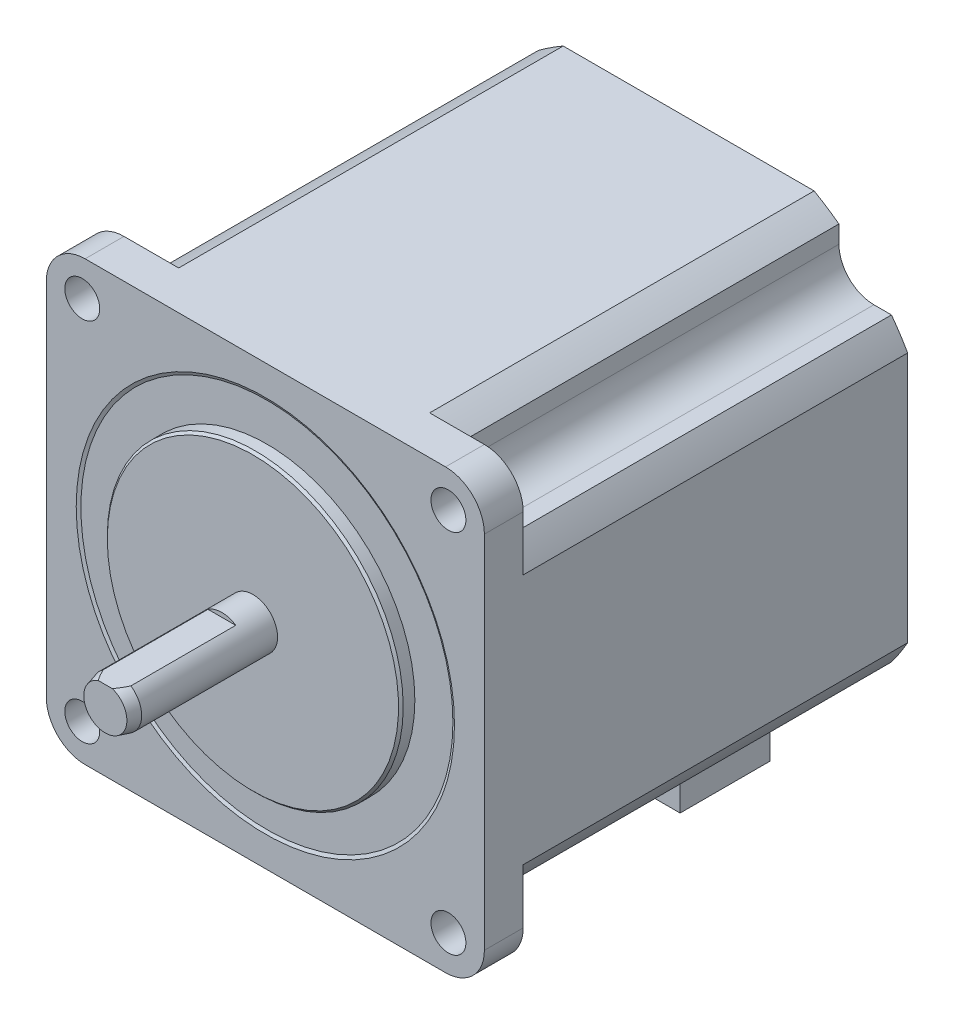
ISO-10303-21;
HEADER;
FILE_DESCRIPTION(('STEP AP214'),'2;1');
FILE_NAME('part.step','',(''),(''),'','','');
FILE_SCHEMA(('AUTOMOTIVE_DESIGN { 1 0 10303 214 1 1 1 1 }'));
ENDSEC;
DATA;
#1=APPLICATION_CONTEXT('core data for automotive mechanical design processes');
#2=APPLICATION_PROTOCOL_DEFINITION('international standard','automotive_design',2000,#1);
#3=PRODUCT_CONTEXT('',#1,'mechanical');
#4=PRODUCT('Part','Part','',(#3));
#5=PRODUCT_RELATED_PRODUCT_CATEGORY('part','',(#4));
#6=PRODUCT_DEFINITION_FORMATION('','',#4);
#7=PRODUCT_DEFINITION_CONTEXT('part definition',#1,'design');
#8=PRODUCT_DEFINITION('design','',#6,#7);
#9=PRODUCT_DEFINITION_SHAPE('','',#8);
#10=(LENGTH_UNIT() NAMED_UNIT(*) SI_UNIT(.MILLI.,.METRE.));
#11=(NAMED_UNIT(*) PLANE_ANGLE_UNIT() SI_UNIT($,.RADIAN.));
#12=(NAMED_UNIT(*) SI_UNIT($,.STERADIAN.) SOLID_ANGLE_UNIT());
#13=UNCERTAINTY_MEASURE_WITH_UNIT(LENGTH_MEASURE(1.E-05),#10,'distance_accuracy_value','');
#14=(GEOMETRIC_REPRESENTATION_CONTEXT(3) GLOBAL_UNCERTAINTY_ASSIGNED_CONTEXT((#13)) GLOBAL_UNIT_ASSIGNED_CONTEXT((#10,
#11,#12)) REPRESENTATION_CONTEXT('',''));
#15=CARTESIAN_POINT('',(0.,0.,0.));
#16=DIRECTION('',(0.,0.,1.));
#17=DIRECTION('',(1.,0.,0.));
#18=AXIS2_PLACEMENT_3D('',#15,#16,#17);
#19=CARTESIAN_POINT('',(0.,0.,-56.1));
#20=DIRECTION('',(0.,0.,-1.));
#21=DIRECTION('',(-1.,0.,0.));
#22=AXIS2_PLACEMENT_3D('',#19,#20,#21);
#23=PLANE('',#22);
#24=DIRECTION('',(0.,1.,0.));
#25=VECTOR('',#24,1.);
#26=CARTESIAN_POINT('',(-28.2,0.,-56.1));
#27=LINE('',#26,#25);
#28=CARTESIAN_POINT('',(-28.2,-16.1558039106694,-56.1));
#29=VERTEX_POINT('',#28);
#30=CARTESIAN_POINT('',(-28.2,16.1558039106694,-56.1));
#31=VERTEX_POINT('',#30);
#32=EDGE_CURVE('E371',#29,#31,#27,.T.);
#33=ORIENTED_EDGE('',*,*,#32,.T.);
#34=CARTESIAN_POINT('',(0.,0.,-56.1));
#35=DIRECTION('',(0.,0.,-1.));
#36=DIRECTION('',(-1.,0.,0.));
#37=AXIS2_PLACEMENT_3D('',#34,#35,#36);
#38=CIRCLE('',#37,32.5);
#39=CARTESIAN_POINT('',(-26.1118268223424,19.35,-56.1));
#40=VERTEX_POINT('',#39);
#41=EDGE_CURVE('E374',#31,#40,#38,.T.);
#42=ORIENTED_EDGE('',*,*,#41,.T.);
#43=DIRECTION('',(-1.,0.,0.));
#44=VECTOR('',#43,1.);
#45=CARTESIAN_POINT('',(0.,19.3500000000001,-56.1));
#46=LINE('',#45,#44);
#47=CARTESIAN_POINT('',(-23.85,19.35,-56.1));
#48=VERTEX_POINT('',#47);
#49=EDGE_CURVE('E378',#48,#40,#46,.T.);
#50=ORIENTED_EDGE('',*,*,#49,.F.);
#51=CARTESIAN_POINT('',(-23.85,23.85,-56.1));
#52=DIRECTION('',(0.,0.,-1.));
#53=DIRECTION('',(-1.,0.,0.));
#54=AXIS2_PLACEMENT_3D('',#51,#52,#53);
#55=CIRCLE('',#54,4.5);
#56=CARTESIAN_POINT('',(-19.35,23.85,-56.1));
#57=VERTEX_POINT('',#56);
#58=EDGE_CURVE('E502',#48,#57,#55,.F.);
#59=ORIENTED_EDGE('',*,*,#58,.T.);
#60=DIRECTION('',(0.,-1.,0.));
#61=VECTOR('',#60,1.);
#62=CARTESIAN_POINT('',(-19.35,0.,-56.1));
#63=LINE('',#62,#61);
#64=CARTESIAN_POINT('',(-19.35,26.1118268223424,-56.1));
#65=VERTEX_POINT('',#64);
#66=EDGE_CURVE('E382',#65,#57,#63,.T.);
#67=ORIENTED_EDGE('',*,*,#66,.F.);
#68=CARTESIAN_POINT('',(-16.1558039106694,28.2,-56.1));
#69=VERTEX_POINT('',#68);
#70=EDGE_CURVE('E380',#65,#69,#38,.T.);
#71=ORIENTED_EDGE('',*,*,#70,.T.);
#72=DIRECTION('',(1.,0.,0.));
#73=VECTOR('',#72,1.);
#74=CARTESIAN_POINT('',(0.,28.2,-56.1));
#75=LINE('',#74,#73);
#76=CARTESIAN_POINT('',(16.1558039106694,28.2,-56.1));
#77=VERTEX_POINT('',#76);
#78=EDGE_CURVE('E385',#69,#77,#75,.T.);
#79=ORIENTED_EDGE('',*,*,#78,.T.);
#80=CARTESIAN_POINT('',(19.35,26.1118268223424,-56.1));
#81=VERTEX_POINT('',#80);
#82=EDGE_CURVE('E387',#77,#81,#38,.T.);
#83=ORIENTED_EDGE('',*,*,#82,.T.);
#84=DIRECTION('',(0.,-1.,0.));
#85=VECTOR('',#84,1.);
#86=CARTESIAN_POINT('',(19.35,0.,-56.1));
#87=LINE('',#86,#85);
#88=CARTESIAN_POINT('',(19.35,23.85,-56.1));
#89=VERTEX_POINT('',#88);
#90=EDGE_CURVE('E388',#81,#89,#87,.T.);
#91=ORIENTED_EDGE('',*,*,#90,.T.);
#92=CARTESIAN_POINT('',(23.85,23.85,-56.1));
#93=DIRECTION('',(0.,0.,-1.));
#94=DIRECTION('',(-1.,0.,0.));
#95=AXIS2_PLACEMENT_3D('',#92,#93,#94);
#96=CIRCLE('',#95,4.5);
#97=CARTESIAN_POINT('',(23.85,19.35,-56.1));
#98=VERTEX_POINT('',#97);
#99=EDGE_CURVE('E504',#89,#98,#96,.F.);
#100=ORIENTED_EDGE('',*,*,#99,.T.);
#101=DIRECTION('',(-1.,0.,0.));
#102=VECTOR('',#101,1.);
#103=CARTESIAN_POINT('',(0.,19.3500000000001,-56.1));
#104=LINE('',#103,#102);
#105=CARTESIAN_POINT('',(26.1118268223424,19.35,-56.1));
#106=VERTEX_POINT('',#105);
#107=EDGE_CURVE('E391',#106,#98,#104,.T.);
#108=ORIENTED_EDGE('',*,*,#107,.F.);
#109=CARTESIAN_POINT('',(28.2,16.1558039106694,-56.1));
#110=VERTEX_POINT('',#109);
#111=EDGE_CURVE('E394',#106,#110,#38,.T.);
#112=ORIENTED_EDGE('',*,*,#111,.T.);
#113=DIRECTION('',(0.,-1.,0.));
#114=VECTOR('',#113,1.);
#115=CARTESIAN_POINT('',(28.2,0.,-56.1));
#116=LINE('',#115,#114);
#117=CARTESIAN_POINT('',(28.2,-16.1558039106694,-56.1));
#118=VERTEX_POINT('',#117);
#119=EDGE_CURVE('E395',#110,#118,#116,.T.);
#120=ORIENTED_EDGE('',*,*,#119,.T.);
#121=CARTESIAN_POINT('',(26.1118268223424,-19.35,-56.1));
#122=VERTEX_POINT('',#121);
#123=EDGE_CURVE('E397',#118,#122,#38,.T.);
#124=ORIENTED_EDGE('',*,*,#123,.T.);
#125=DIRECTION('',(-1.,0.,0.));
#126=VECTOR('',#125,1.);
#127=CARTESIAN_POINT('',(0.,-19.3499999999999,-56.1));
#128=LINE('',#127,#126);
#129=CARTESIAN_POINT('',(23.85,-19.35,-56.1));
#130=VERTEX_POINT('',#129);
#131=EDGE_CURVE('E398',#122,#130,#128,.T.);
#132=ORIENTED_EDGE('',*,*,#131,.T.);
#133=CARTESIAN_POINT('',(23.85,-23.85,-56.1));
#134=DIRECTION('',(0.,0.,-1.));
#135=DIRECTION('',(-1.,0.,0.));
#136=AXIS2_PLACEMENT_3D('',#133,#134,#135);
#137=CIRCLE('',#136,4.5);
#138=CARTESIAN_POINT('',(19.35,-23.85,-56.1));
#139=VERTEX_POINT('',#138);
#140=EDGE_CURVE('E498',#130,#139,#137,.F.);
#141=ORIENTED_EDGE('',*,*,#140,.T.);
#142=DIRECTION('',(0.,-1.,0.));
#143=VECTOR('',#142,1.);
#144=CARTESIAN_POINT('',(19.35,0.,-56.1));
#145=LINE('',#144,#143);
#146=CARTESIAN_POINT('',(19.35,-26.1118268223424,-56.1));
#147=VERTEX_POINT('',#146);
#148=EDGE_CURVE('E401',#139,#147,#145,.T.);
#149=ORIENTED_EDGE('',*,*,#148,.T.);
#150=CARTESIAN_POINT('',(16.1558039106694,-28.2,-56.1));
#151=VERTEX_POINT('',#150);
#152=EDGE_CURVE('E403',#147,#151,#38,.T.);
#153=ORIENTED_EDGE('',*,*,#152,.T.);
#154=DIRECTION('',(-1.,0.,0.));
#155=VECTOR('',#154,1.);
#156=CARTESIAN_POINT('',(0.,-28.2,-56.1));
#157=LINE('',#156,#155);
#158=CARTESIAN_POINT('',(10.5,-28.2,-56.1));
#159=VERTEX_POINT('',#158);
#160=EDGE_CURVE('E404',#151,#159,#157,.T.);
#161=ORIENTED_EDGE('',*,*,#160,.T.);
#162=DIRECTION('',(0.,1.,0.));
#163=VECTOR('',#162,1.);
#164=CARTESIAN_POINT('',(10.5,-38.2,-56.1));
#165=LINE('',#164,#163);
#166=CARTESIAN_POINT('',(10.5,-38.2,-56.1));
#167=VERTEX_POINT('',#166);
#168=EDGE_CURVE('E365',#167,#159,#165,.T.);
#169=ORIENTED_EDGE('',*,*,#168,.F.);
#170=DIRECTION('',(1.,0.,0.));
#171=VECTOR('',#170,1.);
#172=CARTESIAN_POINT('',(-10.5,-38.2,-56.1));
#173=LINE('',#172,#171);
#174=CARTESIAN_POINT('',(-10.5,-38.2,-56.1));
#175=VERTEX_POINT('',#174);
#176=EDGE_CURVE('E348',#175,#167,#173,.T.);
#177=ORIENTED_EDGE('',*,*,#176,.F.);
#178=DIRECTION('',(0.,1.,0.));
#179=VECTOR('',#178,1.);
#180=CARTESIAN_POINT('',(-10.5,-38.2,-56.1));
#181=LINE('',#180,#179);
#182=CARTESIAN_POINT('',(-10.5,-28.2,-56.1));
#183=VERTEX_POINT('',#182);
#184=EDGE_CURVE('E367',#175,#183,#181,.T.);
#185=ORIENTED_EDGE('',*,*,#184,.T.);
#186=CARTESIAN_POINT('',(-16.1558039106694,-28.2,-56.1));
#187=VERTEX_POINT('',#186);
#188=EDGE_CURVE('E408',#183,#187,#157,.T.);
#189=ORIENTED_EDGE('',*,*,#188,.T.);
#190=CARTESIAN_POINT('',(-19.35,-26.1118268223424,-56.1));
#191=VERTEX_POINT('',#190);
#192=EDGE_CURVE('E407',#187,#191,#38,.T.);
#193=ORIENTED_EDGE('',*,*,#192,.T.);
#194=DIRECTION('',(0.,-1.,0.));
#195=VECTOR('',#194,1.);
#196=CARTESIAN_POINT('',(-19.35,0.,-56.1));
#197=LINE('',#196,#195);
#198=CARTESIAN_POINT('',(-19.35,-23.85,-56.1));
#199=VERTEX_POINT('',#198);
#200=EDGE_CURVE('E409',#199,#191,#197,.T.);
#201=ORIENTED_EDGE('',*,*,#200,.F.);
#202=CARTESIAN_POINT('',(-23.85,-23.85,-56.1));
#203=DIRECTION('',(0.,0.,-1.));
#204=DIRECTION('',(-1.,0.,0.));
#205=AXIS2_PLACEMENT_3D('',#202,#203,#204);
#206=CIRCLE('',#205,4.5);
#207=CARTESIAN_POINT('',(-23.85,-19.35,-56.1));
#208=VERTEX_POINT('',#207);
#209=EDGE_CURVE('E500',#199,#208,#206,.F.);
#210=ORIENTED_EDGE('',*,*,#209,.T.);
#211=DIRECTION('',(-1.,0.,0.));
#212=VECTOR('',#211,1.);
#213=CARTESIAN_POINT('',(0.,-19.35,-56.1));
#214=LINE('',#213,#212);
#215=CARTESIAN_POINT('',(-26.1118268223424,-19.35,-56.1));
#216=VERTEX_POINT('',#215);
#217=EDGE_CURVE('E411',#208,#216,#214,.T.);
#218=ORIENTED_EDGE('',*,*,#217,.T.);
#219=EDGE_CURVE('E379',#216,#29,#38,.T.);
#220=ORIENTED_EDGE('',*,*,#219,.T.);
#221=EDGE_LOOP('',(#33,#42,#50,#59,#67,#71,#79,#83,#91,#100,#108,#112,#120,#124,#132,#141,#149,
#153,#161,#169,#177,#185,#189,#193,#201,#210,#218,#220));
#222=FACE_BOUND('',#221,.T.);
#223=CARTESIAN_POINT('',(0.,0.,-56.1));
#224=DIRECTION('',(0.,0.,-1.));
#225=DIRECTION('',(-1.,0.,0.));
#226=AXIS2_PLACEMENT_3D('',#223,#224,#225);
#227=CIRCLE('',#226,3.175);
#228=CARTESIAN_POINT('',(-3.175,0.,-56.1));
#229=VERTEX_POINT('',#228);
#230=EDGE_CURVE('E311',#229,#229,#227,.T.);
#231=ORIENTED_EDGE('',*,*,#230,.F.);
#232=EDGE_LOOP('',(#231));
#233=FACE_BOUND('',#232,.T.);
#234=ADVANCED_FACE('F39',(#222,#233),#23,.T.);
#235=CARTESIAN_POINT('',(0.,0.,19.));
#236=DIRECTION('',(0.,0.,-1.));
#237=DIRECTION('',(-1.,0.,0.));
#238=AXIS2_PLACEMENT_3D('',#235,#236,#237);
#239=CYLINDRICAL_SURFACE('',#238,3.175);
#240=CARTESIAN_POINT('',(0.,0.,17.5));
#241=DIRECTION('',(0.,0.,1.));
#242=DIRECTION('',(1.,0.,0.));
#243=AXIS2_PLACEMENT_3D('',#240,#241,#242);
#244=CIRCLE('',#243,3.175);
#245=CARTESIAN_POINT('',(1.78605710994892,2.625,17.5000000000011));
#246=VERTEX_POINT('',#245);
#247=CARTESIAN_POINT('',(-1.78605710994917,2.625,17.5));
#248=VERTEX_POINT('',#247);
#249=EDGE_CURVE('E509',#246,#248,#244,.F.);
#250=ORIENTED_EDGE('',*,*,#249,.T.);
#251=DIRECTION('',(0.,0.,-1.));
#252=VECTOR('',#251,1.);
#253=CARTESIAN_POINT('',(-1.78605710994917,2.625,19.));
#254=LINE('',#253,#252);
#255=CARTESIAN_POINT('',(-1.78605710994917,2.625,4.));
#256=VERTEX_POINT('',#255);
#257=EDGE_CURVE('E341',#248,#256,#254,.T.);
#258=ORIENTED_EDGE('',*,*,#257,.T.);
#259=CARTESIAN_POINT('',(0.,0.,4.));
#260=DIRECTION('',(0.,0.,1.));
#261=DIRECTION('',(1.,0.,0.));
#262=AXIS2_PLACEMENT_3D('',#259,#260,#261);
#263=CIRCLE('',#262,3.175);
#264=CARTESIAN_POINT('',(1.78605710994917,2.625,4.));
#265=VERTEX_POINT('',#264);
#266=EDGE_CURVE('E520',#265,#256,#263,.T.);
#267=ORIENTED_EDGE('',*,*,#266,.F.);
#268=DIRECTION('',(0.,0.,-1.));
#269=VECTOR('',#268,1.);
#270=CARTESIAN_POINT('',(1.78605710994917,2.625,19.));
#271=LINE('',#270,#269);
#272=EDGE_CURVE('E337',#265,#246,#271,.F.);
#273=ORIENTED_EDGE('',*,*,#272,.T.);
#274=EDGE_LOOP('',(#250,#258,#267,#273));
#275=FACE_BOUND('',#274,.T.);
#276=CARTESIAN_POINT('',(0.,0.,0.));
#277=DIRECTION('',(0.,0.,-1.));
#278=DIRECTION('',(-1.,0.,0.));
#279=AXIS2_PLACEMENT_3D('',#276,#277,#278);
#280=CIRCLE('',#279,3.175);
#281=CARTESIAN_POINT('',(-3.175,0.,0.));
#282=VERTEX_POINT('',#281);
#283=EDGE_CURVE('E808',#282,#282,#280,.T.);
#284=ORIENTED_EDGE('',*,*,#283,.F.);
#285=EDGE_LOOP('',(#284));
#286=FACE_BOUND('',#285,.T.);
#287=ADVANCED_FACE('F557',(#275,#286),#239,.T.);
#288=CARTESIAN_POINT('',(0.,0.,19.));
#289=DIRECTION('',(0.,0.,1.));
#290=DIRECTION('',(1.,0.,0.));
#291=AXIS2_PLACEMENT_3D('',#288,#289,#290);
#292=PLANE('',#291);
#293=DIRECTION('',(1.,0.,0.));
#294=VECTOR('',#293,1.);
#295=CARTESIAN_POINT('',(-4.72781232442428,2.625,19.));
#296=LINE('',#295,#294);
#297=CARTESIAN_POINT('',(-0.894050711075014,2.625,19.));
#298=VERTEX_POINT('',#297);
#299=CARTESIAN_POINT('',(0.894050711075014,2.625,19.));
#300=VERTEX_POINT('',#299);
#301=EDGE_CURVE('E333',#298,#300,#296,.T.);
#302=ORIENTED_EDGE('',*,*,#301,.F.);
#303=CARTESIAN_POINT('',(0.,0.,19.));
#304=DIRECTION('',(0.,0.,1.));
#305=DIRECTION('',(1.,0.,0.));
#306=AXIS2_PLACEMENT_3D('',#303,#304,#305);
#307=CIRCLE('',#306,2.77307621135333);
#308=EDGE_CURVE('E506',#298,#300,#307,.T.);
#309=ORIENTED_EDGE('',*,*,#308,.T.);
#310=EDGE_LOOP('',(#302,#309));
#311=FACE_BOUND('',#310,.T.);
#312=ADVANCED_FACE('F652',(#311),#292,.T.);
#313=CARTESIAN_POINT('',(0.,0.,0.));
#314=DIRECTION('',(0.,0.,-1.));
#315=DIRECTION('',(-1.,0.,0.));
#316=AXIS2_PLACEMENT_3D('',#313,#314,#315);
#317=PLANE('',#316);
#318=CARTESIAN_POINT('',(0.,0.,0.));
#319=DIRECTION('',(0.,0.,-1.));
#320=DIRECTION('',(-1.,0.,0.));
#321=AXIS2_PLACEMENT_3D('',#318,#319,#320);
#322=CIRCLE('',#321,18.75);
#323=CARTESIAN_POINT('',(-18.75,0.,0.));
#324=VERTEX_POINT('',#323);
#325=EDGE_CURVE('E1361',#324,#324,#322,.F.);
#326=ORIENTED_EDGE('',*,*,#325,.T.);
#327=EDGE_LOOP('',(#326));
#328=FACE_BOUND('',#327,.T.);
#329=ORIENTED_EDGE('',*,*,#283,.T.);
#330=EDGE_LOOP('',(#329));
#331=FACE_BOUND('',#330,.T.);
#332=ADVANCED_FACE('F648',(#328,#331),#317,.F.);
#333=CARTESIAN_POINT('',(0.,0.,-1.6));
#334=DIRECTION('',(0.,0.,1.));
#335=DIRECTION('',(1.,0.,0.));
#336=AXIS2_PLACEMENT_3D('',#333,#334,#335);
#337=CYLINDRICAL_SURFACE('',#336,19.05);
#338=CARTESIAN_POINT('',(0.,0.,-0.300000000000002));
#339=DIRECTION('',(0.,0.,-1.));
#340=DIRECTION('',(-1.,0.,0.));
#341=AXIS2_PLACEMENT_3D('',#338,#339,#340);
#342=CIRCLE('',#341,19.05);
#343=CARTESIAN_POINT('',(-19.05,0.,-0.300000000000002));
#344=VERTEX_POINT('',#343);
#345=EDGE_CURVE('E1364',#344,#344,#342,.T.);
#346=ORIENTED_EDGE('',*,*,#345,.T.);
#347=EDGE_LOOP('',(#346));
#348=FACE_BOUND('',#347,.T.);
#349=CARTESIAN_POINT('',(0.,0.,-1.8));
#350=DIRECTION('',(0.,0.,1.));
#351=DIRECTION('',(1.,0.,0.));
#352=AXIS2_PLACEMENT_3D('',#349,#350,#351);
#353=CIRCLE('',#352,19.05);
#354=CARTESIAN_POINT('',(19.05,0.,-1.8));
#355=VERTEX_POINT('',#354);
#356=EDGE_CURVE('E327',#355,#355,#353,.T.);
#357=ORIENTED_EDGE('',*,*,#356,.T.);
#358=EDGE_LOOP('',(#357));
#359=FACE_BOUND('',#358,.T.);
#360=ADVANCED_FACE('F651',(#348,#359),#337,.T.);
#361=CARTESIAN_POINT('',(0.,0.,19.));
#362=DIRECTION('',(0.,0.,-1.));
#363=DIRECTION('',(-1.,0.,0.));
#364=AXIS2_PLACEMENT_3D('',#361,#362,#363);
#365=CONICAL_SURFACE('',#364,2.77307621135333,0.261799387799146);
#366=CARTESIAN_POINT('',(-3.30935894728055,2.625,13.5849436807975));
#367=CARTESIAN_POINT('',(-3.24542473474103,2.625,13.7718399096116));
#368=CARTESIAN_POINT('',(-3.180873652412,2.625,13.9585279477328));
#369=CARTESIAN_POINT('',(-3.05023975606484,2.625,14.3313889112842));
#370=CARTESIAN_POINT('',(-2.98415678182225,2.625,14.5175617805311));
#371=CARTESIAN_POINT('',(-2.85014549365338,2.625,14.8893346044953));
#372=CARTESIAN_POINT('',(-2.7822163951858,2.625,15.0749342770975));
#373=CARTESIAN_POINT('',(-2.64413585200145,2.625,15.4452951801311));
#374=CARTESIAN_POINT('',(-2.57398453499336,2.625,15.630056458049));
#375=CARTESIAN_POINT('',(-2.43088450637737,2.625,15.9985625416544));
#376=CARTESIAN_POINT('',(-2.35793492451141,2.625,16.1823070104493));
#377=CARTESIAN_POINT('',(-2.2084743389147,2.625,16.5483836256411));
#378=CARTESIAN_POINT('',(-2.13196278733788,2.625,16.730715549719));
#379=CARTESIAN_POINT('',(-1.97412292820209,2.625,17.0936282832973));
#380=CARTESIAN_POINT('',(-1.89278731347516,2.625,17.2742059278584));
#381=CARTESIAN_POINT('',(-1.72367545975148,2.625,17.6322943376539));
#382=CARTESIAN_POINT('',(-1.63590163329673,2.625,17.8098062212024));
#383=CARTESIAN_POINT('',(-1.49689402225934,2.625,18.0727010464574));
#384=CARTESIAN_POINT('',(-1.44921905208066,2.625,18.159961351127));
#385=CARTESIAN_POINT('',(-1.35081442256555,2.625,18.3328001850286));
#386=CARTESIAN_POINT('',(-1.3000836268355,2.625,18.4183780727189));
#387=CARTESIAN_POINT('',(-1.19492866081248,2.625,18.5868191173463));
#388=CARTESIAN_POINT('',(-1.14051856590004,2.625,18.6696910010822));
#389=CARTESIAN_POINT('',(-1.02665023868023,2.625,18.8318604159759));
#390=CARTESIAN_POINT('',(-0.967196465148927,2.625,18.9111610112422));
#391=CARTESIAN_POINT('',(-0.862242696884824,2.625,19.0387203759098));
#392=CARTESIAN_POINT('',(-0.818661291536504,2.625,19.0885458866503));
#393=CARTESIAN_POINT('',(-0.727513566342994,2.625,19.1846578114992));
#394=CARTESIAN_POINT('',(-0.679939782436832,2.625,19.2309372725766));
#395=CARTESIAN_POINT('',(-0.579402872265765,2.625,19.3185048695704));
#396=CARTESIAN_POINT('',(-0.526387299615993,2.625,19.3597339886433));
#397=CARTESIAN_POINT('',(-0.414507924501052,2.625,19.4333493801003));
#398=CARTESIAN_POINT('',(-0.355665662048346,2.625,19.4657666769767));
#399=CARTESIAN_POINT('',(-0.254920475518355,2.625,19.5076037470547));
#400=CARTESIAN_POINT('',(-0.214733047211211,2.625,19.5210971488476));
#401=CARTESIAN_POINT('',(-0.132696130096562,2.625,19.5413023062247));
#402=CARTESIAN_POINT('',(-0.0908493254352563,2.625,19.5480245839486));
#403=CARTESIAN_POINT('',(-0.00641419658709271,2.625,19.5538691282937));
#404=CARTESIAN_POINT('',(0.0361766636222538,2.625,19.5529560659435));
#405=CARTESIAN_POINT('',(0.120530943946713,2.625,19.5435732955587));
#406=CARTESIAN_POINT('',(0.162293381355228,2.625,19.5350951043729));
#407=CARTESIAN_POINT('',(0.254092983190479,2.625,19.5086701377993));
#408=CARTESIAN_POINT('',(0.303590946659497,2.625,19.488887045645));
#409=CARTESIAN_POINT('',(0.398827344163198,2.625,19.441778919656));
#410=CARTESIAN_POINT('',(0.444557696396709,2.625,19.4144381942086));
#411=CARTESIAN_POINT('',(0.528152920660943,2.625,19.3573624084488));
#412=CARTESIAN_POINT('',(0.566351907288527,2.625,19.328105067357));
#413=CARTESIAN_POINT('',(0.640136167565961,2.625,19.266433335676));
#414=CARTESIAN_POINT('',(0.67571899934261,2.625,19.2340160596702));
#415=CARTESIAN_POINT('',(0.744720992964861,2.625,19.166764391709));
#416=CARTESIAN_POINT('',(0.778132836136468,2.625,19.1319225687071));
#417=CARTESIAN_POINT('',(0.842993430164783,2.625,19.0605004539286));
#418=CARTESIAN_POINT('',(0.874443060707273,2.625,19.0239209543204));
#419=CARTESIAN_POINT('',(0.960526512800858,2.625,18.9192141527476));
#420=CARTESIAN_POINT('',(1.01328788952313,2.625,18.8495504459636));
#421=CARTESIAN_POINT('',(1.11474355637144,2.625,18.7073019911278));
#422=CARTESIAN_POINT('',(1.16343498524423,2.625,18.6347152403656));
#423=CARTESIAN_POINT('',(1.25772470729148,2.625,18.487351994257));
#424=CARTESIAN_POINT('',(1.30331615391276,2.625,18.4125711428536));
#425=CARTESIAN_POINT('',(1.39194135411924,2.625,18.2615031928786));
#426=CARTESIAN_POINT('',(1.43497467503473,2.625,18.185215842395));
#427=CARTESIAN_POINT('',(1.56162993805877,2.625,17.9534626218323));
#428=CARTESIAN_POINT('',(1.64208680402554,2.625,17.7962698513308));
#429=CARTESIAN_POINT('',(1.79705705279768,2.625,17.4792970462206));
#430=CARTESIAN_POINT('',(1.87157841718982,2.625,17.3195208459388));
#431=CARTESIAN_POINT('',(2.01054641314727,2.625,17.0108615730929));
#432=CARTESIAN_POINT('',(2.07532251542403,2.625,16.8621261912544));
#433=CARTESIAN_POINT('',(2.20202359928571,2.625,16.56344277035));
#434=CARTESIAN_POINT('',(2.26394842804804,2.625,16.4134946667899));
#435=CARTESIAN_POINT('',(2.44641955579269,2.625,15.9620477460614));
#436=CARTESIAN_POINT('',(2.56356197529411,2.625,15.6591749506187));
#437=CARTESIAN_POINT('',(2.78774888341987,2.625,15.0616544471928));
#438=CARTESIAN_POINT('',(2.89500244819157,2.625,14.7670842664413));
#439=CARTESIAN_POINT('',(3.05264619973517,2.625,14.3242983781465));
#440=CARTESIAN_POINT('',(3.10462177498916,2.625,14.1766447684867));
#441=CARTESIAN_POINT('',(3.20764960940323,2.625,13.8810202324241));
#442=CARTESIAN_POINT('',(3.25870189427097,2.625,13.733049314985));
#443=CARTESIAN_POINT('',(3.30935894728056,2.625,13.5849436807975));
#444=B_SPLINE_CURVE_WITH_KNOTS('',3,(#366,#367,#368,#369,#370,#371,#372,#373,#374,#375,#376,
#377,#378,#379,#380,#381,#382,#383,#384,#385,#386,#387,#388,#389,#390,#391,#392,#393,#394,#395,
#396,#397,#398,#399,#400,#401,#402,#403,#404,#405,#406,#407,#408,#409,#410,#411,#412,#413,#414,
#415,#416,#417,#418,#419,#420,#421,#422,#423,#424,#425,#426,#427,#428,#429,#430,#431,#432,#433,
#434,#435,#436,#437,#438,#439,#440,#441,#442,#443),.UNSPECIFIED.,.F.,.F.,(4,2,2,2,2,2,2,2,2,2,2,
2,2,2,2,2,2,2,2,2,2,2,2,2,2,2,2,2,2,2,2,2,2,2,2,2,2,2,4),(0.,0.592590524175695,1.18524331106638,
1.77815202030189,2.37102671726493,2.964087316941,3.55723943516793,4.15131417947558,
4.74516743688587,5.04342777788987,5.34179972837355,5.6390885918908,5.9361173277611,
6.13455567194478,6.33337364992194,6.53432931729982,6.7345680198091,6.86126706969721,
6.98776892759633,7.11485643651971,7.24208663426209,7.40110146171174,7.56044895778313,
7.70458491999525,7.84885375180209,7.99358608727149,8.13825306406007,8.40019160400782,
8.66231276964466,8.92499521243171,9.18772195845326,9.71727649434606,10.2461064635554,
10.7327538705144,11.2194273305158,12.1935231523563,13.133951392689,13.6035521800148,
14.0731398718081),.UNSPECIFIED.);
#445=EDGE_CURVE('E519',#248,#298,#444,.T.);
#446=ORIENTED_EDGE('',*,*,#445,.F.);
#447=ORIENTED_EDGE('',*,*,#249,.F.);
#448=EDGE_CURVE('E512',#300,#246,#444,.T.);
#449=ORIENTED_EDGE('',*,*,#448,.F.);
#450=ORIENTED_EDGE('',*,*,#308,.F.);
#451=EDGE_LOOP('',(#446,#447,#449,#450));
#452=FACE_BOUND('',#451,.T.);
#453=ADVANCED_FACE('F522',(#452),#365,.T.);
#454=CARTESIAN_POINT('',(0.,0.,4.));
#455=DIRECTION('',(0.,0.,1.));
#456=DIRECTION('',(1.,0.,0.));
#457=AXIS2_PLACEMENT_3D('',#454,#455,#456);
#458=PLANE('',#457);
#459=ORIENTED_EDGE('',*,*,#266,.T.);
#460=DIRECTION('',(1.,0.,0.));
#461=VECTOR('',#460,1.);
#462=CARTESIAN_POINT('',(-4.72781232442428,2.625,4.));
#463=LINE('',#462,#461);
#464=EDGE_CURVE('E334',#256,#265,#463,.T.);
#465=ORIENTED_EDGE('',*,*,#464,.T.);
#466=EDGE_LOOP('',(#459,#465));
#467=FACE_BOUND('',#466,.T.);
#468=ADVANCED_FACE('F532',(#467),#458,.T.);
#469=CARTESIAN_POINT('',(-4.72781232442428,2.625,4.));
#470=DIRECTION('',(0.,-1.,0.));
#471=DIRECTION('',(0.,0.,-1.));
#472=AXIS2_PLACEMENT_3D('',#469,#470,#471);
#473=PLANE('',#472);
#474=ORIENTED_EDGE('',*,*,#445,.T.);
#475=ORIENTED_EDGE('',*,*,#301,.T.);
#476=ORIENTED_EDGE('',*,*,#448,.T.);
#477=ORIENTED_EDGE('',*,*,#272,.F.);
#478=ORIENTED_EDGE('',*,*,#464,.F.);
#479=ORIENTED_EDGE('',*,*,#257,.F.);
#480=EDGE_LOOP('',(#474,#475,#476,#477,#478,#479));
#481=FACE_BOUND('',#480,.T.);
#482=ADVANCED_FACE('F526',(#481),#473,.F.);
#483=CARTESIAN_POINT('',(0.,0.,-1.8));
#484=DIRECTION('',(0.,0.,1.));
#485=DIRECTION('',(1.,0.,0.));
#486=AXIS2_PLACEMENT_3D('',#483,#484,#485);
#487=PLANE('',#486);
#488=CARTESIAN_POINT('',(0.,0.,-1.8));
#489=DIRECTION('',(0.,0.,1.));
#490=DIRECTION('',(1.,0.,0.));
#491=AXIS2_PLACEMENT_3D('',#488,#489,#490);
#492=CIRCLE('',#491,23.95);
#493=CARTESIAN_POINT('',(23.95,0.,-1.8));
#494=VERTEX_POINT('',#493);
#495=EDGE_CURVE('E1366',#494,#494,#492,.T.);
#496=ORIENTED_EDGE('',*,*,#495,.T.);
#497=EDGE_LOOP('',(#496));
#498=FACE_BOUND('',#497,.T.);
#499=ORIENTED_EDGE('',*,*,#356,.F.);
#500=EDGE_LOOP('',(#499));
#501=FACE_BOUND('',#500,.T.);
#502=ADVANCED_FACE('F531',(#498,#501),#487,.T.);
#503=CARTESIAN_POINT('',(0.,-19.35,-56.1));
#504=DIRECTION('',(0.,1.,0.));
#505=DIRECTION('',(-1.,0.,0.));
#506=AXIS2_PLACEMENT_3D('',#503,#504,#505);
#507=PLANE('',#506);
#508=ORIENTED_EDGE('',*,*,#217,.F.);
#509=DIRECTION('',(0.,0.,1.));
#510=VECTOR('',#509,1.);
#511=CARTESIAN_POINT('',(-23.85,-19.35,-56.1));
#512=LINE('',#511,#510);
#513=CARTESIAN_POINT('',(-23.85,-19.35,-6.6));
#514=VERTEX_POINT('',#513);
#515=EDGE_CURVE('E477',#208,#514,#512,.T.);
#516=ORIENTED_EDGE('',*,*,#515,.T.);
#517=DIRECTION('',(-1.,0.,0.));
#518=VECTOR('',#517,1.);
#519=CARTESIAN_POINT('',(0.,-19.35,-6.6));
#520=LINE('',#519,#518);
#521=CARTESIAN_POINT('',(-26.1118268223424,-19.35,-6.6));
#522=VERTEX_POINT('',#521);
#523=EDGE_CURVE('E731',#514,#522,#520,.T.);
#524=ORIENTED_EDGE('',*,*,#523,.T.);
#525=DIRECTION('',(0.,0.,1.));
#526=VECTOR('',#525,1.);
#527=CARTESIAN_POINT('',(-26.1118268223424,-19.35,-56.1));
#528=LINE('',#527,#526);
#529=EDGE_CURVE('E718',#216,#522,#528,.T.);
#530=ORIENTED_EDGE('',*,*,#529,.F.);
#531=EDGE_LOOP('',(#508,#516,#524,#530));
#532=FACE_BOUND('',#531,.T.);
#533=ADVANCED_FACE('F566',(#532),#507,.F.);
#534=CARTESIAN_POINT('',(-23.85,-23.85,-56.1));
#535=DIRECTION('',(0.,0.,1.));
#536=DIRECTION('',(1.,0.,0.));
#537=AXIS2_PLACEMENT_3D('',#534,#535,#536);
#538=CYLINDRICAL_SURFACE('',#537,4.5);
#539=ORIENTED_EDGE('',*,*,#209,.F.);
#540=DIRECTION('',(0.,0.,1.));
#541=VECTOR('',#540,1.);
#542=CARTESIAN_POINT('',(-19.35,-23.85,-56.1));
#543=LINE('',#542,#541);
#544=CARTESIAN_POINT('',(-19.35,-23.85,-6.6));
#545=VERTEX_POINT('',#544);
#546=EDGE_CURVE('E482',#545,#199,#543,.F.);
#547=ORIENTED_EDGE('',*,*,#546,.F.);
#548=CARTESIAN_POINT('',(-23.85,-23.85,-6.6));
#549=DIRECTION('',(0.,0.,-1.));
#550=DIRECTION('',(-1.,0.,0.));
#551=AXIS2_PLACEMENT_3D('',#548,#549,#550);
#552=CIRCLE('',#551,4.5);
#553=EDGE_CURVE('E480',#514,#545,#552,.T.);
#554=ORIENTED_EDGE('',*,*,#553,.F.);
#555=ORIENTED_EDGE('',*,*,#515,.F.);
#556=EDGE_LOOP('',(#539,#547,#554,#555));
#557=FACE_BOUND('',#556,.T.);
#558=ADVANCED_FACE('F569',(#557),#538,.F.);
#559=CARTESIAN_POINT('',(-19.35,0.,-56.1));
#560=DIRECTION('',(-1.,0.,0.));
#561=DIRECTION('',(0.,-1.,0.));
#562=AXIS2_PLACEMENT_3D('',#559,#560,#561);
#563=PLANE('',#562);
#564=DIRECTION('',(0.,-1.,0.));
#565=VECTOR('',#564,1.);
#566=CARTESIAN_POINT('',(-19.35,0.,-6.6));
#567=LINE('',#566,#565);
#568=CARTESIAN_POINT('',(-19.35,-26.1118268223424,-6.6));
#569=VERTEX_POINT('',#568);
#570=EDGE_CURVE('E884',#545,#569,#567,.T.);
#571=ORIENTED_EDGE('',*,*,#570,.F.);
#572=ORIENTED_EDGE('',*,*,#546,.T.);
#573=ORIENTED_EDGE('',*,*,#200,.T.);
#574=DIRECTION('',(0.,0.,1.));
#575=VECTOR('',#574,1.);
#576=CARTESIAN_POINT('',(-19.35,-26.1118268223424,-56.1));
#577=LINE('',#576,#575);
#578=EDGE_CURVE('E722',#191,#569,#577,.T.);
#579=ORIENTED_EDGE('',*,*,#578,.T.);
#580=EDGE_LOOP('',(#571,#572,#573,#579));
#581=FACE_BOUND('',#580,.T.);
#582=ADVANCED_FACE('F571',(#581),#563,.T.);
#583=CARTESIAN_POINT('',(-19.35,0.,-56.1));
#584=DIRECTION('',(-1.,0.,0.));
#585=DIRECTION('',(0.,0.,1.));
#586=AXIS2_PLACEMENT_3D('',#583,#584,#585);
#587=PLANE('',#586);
#588=ORIENTED_EDGE('',*,*,#66,.T.);
#589=DIRECTION('',(0.,0.,1.));
#590=VECTOR('',#589,1.);
#591=CARTESIAN_POINT('',(-19.35,23.85,-6.6));
#592=LINE('',#591,#590);
#593=CARTESIAN_POINT('',(-19.35,23.85,-6.6));
#594=VERTEX_POINT('',#593);
#595=EDGE_CURVE('E484',#57,#594,#592,.T.);
#596=ORIENTED_EDGE('',*,*,#595,.T.);
#597=DIRECTION('',(0.,-1.,0.));
#598=VECTOR('',#597,1.);
#599=CARTESIAN_POINT('',(-19.35,0.,-6.6));
#600=LINE('',#599,#598);
#601=CARTESIAN_POINT('',(-19.35,26.1118268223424,-6.6));
#602=VERTEX_POINT('',#601);
#603=EDGE_CURVE('E463',#602,#594,#600,.T.);
#604=ORIENTED_EDGE('',*,*,#603,.F.);
#605=DIRECTION('',(0.,0.,1.));
#606=VECTOR('',#605,1.);
#607=CARTESIAN_POINT('',(-19.35,26.1118268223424,-56.1));
#608=LINE('',#607,#606);
#609=EDGE_CURVE('E466',#65,#602,#608,.T.);
#610=ORIENTED_EDGE('',*,*,#609,.F.);
#611=EDGE_LOOP('',(#588,#596,#604,#610));
#612=FACE_BOUND('',#611,.T.);
#613=ADVANCED_FACE('F574',(#612),#587,.T.);
#614=CARTESIAN_POINT('',(-23.85,23.85,-56.1));
#615=DIRECTION('',(0.,0.,-1.));
#616=DIRECTION('',(-1.,0.,0.));
#617=AXIS2_PLACEMENT_3D('',#614,#615,#616);
#618=CYLINDRICAL_SURFACE('',#617,4.5);
#619=ORIENTED_EDGE('',*,*,#58,.F.);
#620=DIRECTION('',(0.,0.,1.));
#621=VECTOR('',#620,1.);
#622=CARTESIAN_POINT('',(-23.85,19.35,-56.1));
#623=LINE('',#622,#621);
#624=CARTESIAN_POINT('',(-23.85,19.35,-6.6));
#625=VERTEX_POINT('',#624);
#626=EDGE_CURVE('E489',#625,#48,#623,.F.);
#627=ORIENTED_EDGE('',*,*,#626,.F.);
#628=CARTESIAN_POINT('',(-23.85,23.85,-6.6));
#629=DIRECTION('',(0.,0.,-1.));
#630=DIRECTION('',(-1.,0.,0.));
#631=AXIS2_PLACEMENT_3D('',#628,#629,#630);
#632=CIRCLE('',#631,4.5);
#633=EDGE_CURVE('E487',#594,#625,#632,.T.);
#634=ORIENTED_EDGE('',*,*,#633,.F.);
#635=ORIENTED_EDGE('',*,*,#595,.F.);
#636=EDGE_LOOP('',(#619,#627,#634,#635));
#637=FACE_BOUND('',#636,.T.);
#638=ADVANCED_FACE('F594',(#637),#618,.F.);
#639=CARTESIAN_POINT('',(0.,19.3500000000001,-56.1));
#640=DIRECTION('',(0.,1.,0.));
#641=DIRECTION('',(-1.,0.,0.));
#642=AXIS2_PLACEMENT_3D('',#639,#640,#641);
#643=PLANE('',#642);
#644=DIRECTION('',(-1.,0.,0.));
#645=VECTOR('',#644,1.);
#646=CARTESIAN_POINT('',(0.,19.3500000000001,-6.6));
#647=LINE('',#646,#645);
#648=CARTESIAN_POINT('',(-26.1118268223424,19.35,-6.6));
#649=VERTEX_POINT('',#648);
#650=EDGE_CURVE('E415',#625,#649,#647,.T.);
#651=ORIENTED_EDGE('',*,*,#650,.F.);
#652=ORIENTED_EDGE('',*,*,#626,.T.);
#653=ORIENTED_EDGE('',*,*,#49,.T.);
#654=DIRECTION('',(0.,0.,1.));
#655=VECTOR('',#654,1.);
#656=CARTESIAN_POINT('',(-26.1118268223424,19.35,-56.1));
#657=LINE('',#656,#655);
#658=EDGE_CURVE('E746',#40,#649,#657,.T.);
#659=ORIENTED_EDGE('',*,*,#658,.T.);
#660=EDGE_LOOP('',(#651,#652,#653,#659));
#661=FACE_BOUND('',#660,.T.);
#662=ADVANCED_FACE('F539',(#661),#643,.T.);
#663=CARTESIAN_POINT('',(0.,-38.2,0.));
#664=DIRECTION('',(0.,1.,0.));
#665=DIRECTION('',(0.,0.,1.));
#666=AXIS2_PLACEMENT_3D('',#663,#664,#665);
#667=PLANE('',#666);
#668=DIRECTION('',(0.,0.,-1.));
#669=VECTOR('',#668,1.);
#670=CARTESIAN_POINT('',(-10.5,-38.2,-56.1));
#671=LINE('',#670,#669);
#672=CARTESIAN_POINT('',(-10.5,-38.2,-44.5));
#673=VERTEX_POINT('',#672);
#674=EDGE_CURVE('E345',#673,#175,#671,.T.);
#675=ORIENTED_EDGE('',*,*,#674,.T.);
#676=ORIENTED_EDGE('',*,*,#176,.T.);
#677=DIRECTION('',(0.,0.,1.));
#678=VECTOR('',#677,1.);
#679=CARTESIAN_POINT('',(10.5,-38.2,-56.1));
#680=LINE('',#679,#678);
#681=CARTESIAN_POINT('',(10.5,-38.2,-44.5));
#682=VERTEX_POINT('',#681);
#683=EDGE_CURVE('E351',#167,#682,#680,.T.);
#684=ORIENTED_EDGE('',*,*,#683,.T.);
#685=DIRECTION('',(-1.,0.,0.));
#686=VECTOR('',#685,1.);
#687=CARTESIAN_POINT('',(-10.5,-38.2,-44.5));
#688=LINE('',#687,#686);
#689=EDGE_CURVE('E353',#682,#673,#688,.T.);
#690=ORIENTED_EDGE('',*,*,#689,.T.);
#691=EDGE_LOOP('',(#675,#676,#684,#690));
#692=FACE_BOUND('',#691,.T.);
#693=ADVANCED_FACE('F535',(#692),#667,.F.);
#694=CARTESIAN_POINT('',(19.35,0.,-56.1));
#695=DIRECTION('',(-1.,0.,0.));
#696=DIRECTION('',(0.,-1.,0.));
#697=AXIS2_PLACEMENT_3D('',#694,#695,#696);
#698=PLANE('',#697);
#699=DIRECTION('',(0.,-1.,0.));
#700=VECTOR('',#699,1.);
#701=CARTESIAN_POINT('',(19.35,0.,-6.6));
#702=LINE('',#701,#700);
#703=CARTESIAN_POINT('',(19.35,26.1118268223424,-6.6));
#704=VERTEX_POINT('',#703);
#705=CARTESIAN_POINT('',(19.35,23.85,-6.6));
#706=VERTEX_POINT('',#705);
#707=EDGE_CURVE('E452',#704,#706,#702,.T.);
#708=ORIENTED_EDGE('',*,*,#707,.T.);
#709=DIRECTION('',(0.,0.,1.));
#710=VECTOR('',#709,1.);
#711=CARTESIAN_POINT('',(19.35,23.85,-56.1));
#712=LINE('',#711,#710);
#713=EDGE_CURVE('E496',#706,#89,#712,.F.);
#714=ORIENTED_EDGE('',*,*,#713,.T.);
#715=ORIENTED_EDGE('',*,*,#90,.F.);
#716=DIRECTION('',(0.,0.,1.));
#717=VECTOR('',#716,1.);
#718=CARTESIAN_POINT('',(19.35,26.1118268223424,-56.1));
#719=LINE('',#718,#717);
#720=EDGE_CURVE('E459',#81,#704,#719,.T.);
#721=ORIENTED_EDGE('',*,*,#720,.T.);
#722=EDGE_LOOP('',(#708,#714,#715,#721));
#723=FACE_BOUND('',#722,.T.);
#724=ADVANCED_FACE('F538',(#723),#698,.F.);
#725=CARTESIAN_POINT('',(23.85,23.85,-56.1));
#726=DIRECTION('',(0.,0.,1.));
#727=DIRECTION('',(1.,0.,0.));
#728=AXIS2_PLACEMENT_3D('',#725,#726,#727);
#729=CYLINDRICAL_SURFACE('',#728,4.5);
#730=ORIENTED_EDGE('',*,*,#99,.F.);
#731=ORIENTED_EDGE('',*,*,#713,.F.);
#732=CARTESIAN_POINT('',(23.85,23.85,-6.6));
#733=DIRECTION('',(0.,0.,-1.));
#734=DIRECTION('',(-1.,0.,0.));
#735=AXIS2_PLACEMENT_3D('',#732,#733,#734);
#736=CIRCLE('',#735,4.5);
#737=CARTESIAN_POINT('',(23.85,19.35,-6.6));
#738=VERTEX_POINT('',#737);
#739=EDGE_CURVE('E494',#738,#706,#736,.T.);
#740=ORIENTED_EDGE('',*,*,#739,.F.);
#741=DIRECTION('',(0.,0.,1.));
#742=VECTOR('',#741,1.);
#743=CARTESIAN_POINT('',(23.85,19.35,-56.1));
#744=LINE('',#743,#742);
#745=EDGE_CURVE('E491',#98,#738,#744,.T.);
#746=ORIENTED_EDGE('',*,*,#745,.F.);
#747=EDGE_LOOP('',(#730,#731,#740,#746));
#748=FACE_BOUND('',#747,.T.);
#749=ADVANCED_FACE('F587',(#748),#729,.F.);
#750=CARTESIAN_POINT('',(0.,19.3500000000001,-56.1));
#751=DIRECTION('',(0.,1.,0.));
#752=DIRECTION('',(-1.,0.,0.));
#753=AXIS2_PLACEMENT_3D('',#750,#751,#752);
#754=PLANE('',#753);
#755=ORIENTED_EDGE('',*,*,#107,.T.);
#756=ORIENTED_EDGE('',*,*,#745,.T.);
#757=DIRECTION('',(-1.,0.,0.));
#758=VECTOR('',#757,1.);
#759=CARTESIAN_POINT('',(0.,19.3500000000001,-6.6));
#760=LINE('',#759,#758);
#761=CARTESIAN_POINT('',(26.1118268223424,19.35,-6.6));
#762=VERTEX_POINT('',#761);
#763=EDGE_CURVE('E698',#762,#738,#760,.T.);
#764=ORIENTED_EDGE('',*,*,#763,.F.);
#765=DIRECTION('',(0.,0.,1.));
#766=VECTOR('',#765,1.);
#767=CARTESIAN_POINT('',(26.1118268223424,19.35,-56.1));
#768=LINE('',#767,#766);
#769=EDGE_CURVE('E696',#106,#762,#768,.T.);
#770=ORIENTED_EDGE('',*,*,#769,.F.);
#771=EDGE_LOOP('',(#755,#756,#764,#770));
#772=FACE_BOUND('',#771,.T.);
#773=ADVANCED_FACE('F583',(#772),#754,.T.);
#774=CARTESIAN_POINT('',(0.,-19.3499999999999,-56.1));
#775=DIRECTION('',(0.,1.,0.));
#776=DIRECTION('',(-1.,0.,0.));
#777=AXIS2_PLACEMENT_3D('',#774,#775,#776);
#778=PLANE('',#777);
#779=DIRECTION('',(-1.,0.,0.));
#780=VECTOR('',#779,1.);
#781=CARTESIAN_POINT('',(0.,-19.3499999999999,-6.6));
#782=LINE('',#781,#780);
#783=CARTESIAN_POINT('',(26.1118268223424,-19.35,-6.6));
#784=VERTEX_POINT('',#783);
#785=CARTESIAN_POINT('',(23.85,-19.35,-6.6));
#786=VERTEX_POINT('',#785);
#787=EDGE_CURVE('E885',#784,#786,#782,.T.);
#788=ORIENTED_EDGE('',*,*,#787,.T.);
#789=DIRECTION('',(0.,0.,1.));
#790=VECTOR('',#789,1.);
#791=CARTESIAN_POINT('',(23.85,-19.35,-56.1));
#792=LINE('',#791,#790);
#793=EDGE_CURVE('E475',#786,#130,#792,.F.);
#794=ORIENTED_EDGE('',*,*,#793,.T.);
#795=ORIENTED_EDGE('',*,*,#131,.F.);
#796=DIRECTION('',(0.,0.,1.));
#797=VECTOR('',#796,1.);
#798=CARTESIAN_POINT('',(26.1118268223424,-19.35,-56.1));
#799=LINE('',#798,#797);
#800=EDGE_CURVE('E737',#122,#784,#799,.T.);
#801=ORIENTED_EDGE('',*,*,#800,.T.);
#802=EDGE_LOOP('',(#788,#794,#795,#801));
#803=FACE_BOUND('',#802,.T.);
#804=ADVANCED_FACE('F580',(#803),#778,.F.);
#805=CARTESIAN_POINT('',(23.85,-23.85,-56.1));
#806=DIRECTION('',(0.,0.,-1.));
#807=DIRECTION('',(-1.,0.,0.));
#808=AXIS2_PLACEMENT_3D('',#805,#806,#807);
#809=CYLINDRICAL_SURFACE('',#808,4.5);
#810=ORIENTED_EDGE('',*,*,#140,.F.);
#811=ORIENTED_EDGE('',*,*,#793,.F.);
#812=CARTESIAN_POINT('',(23.85,-23.85,-6.6));
#813=DIRECTION('',(0.,0.,-1.));
#814=DIRECTION('',(-1.,0.,0.));
#815=AXIS2_PLACEMENT_3D('',#812,#813,#814);
#816=CIRCLE('',#815,4.5);
#817=CARTESIAN_POINT('',(19.35,-23.85,-6.6));
#818=VERTEX_POINT('',#817);
#819=EDGE_CURVE('E472',#818,#786,#816,.T.);
#820=ORIENTED_EDGE('',*,*,#819,.F.);
#821=DIRECTION('',(0.,0.,1.));
#822=VECTOR('',#821,1.);
#823=CARTESIAN_POINT('',(19.35,-23.85,-6.6));
#824=LINE('',#823,#822);
#825=EDGE_CURVE('E469',#139,#818,#824,.T.);
#826=ORIENTED_EDGE('',*,*,#825,.F.);
#827=EDGE_LOOP('',(#810,#811,#820,#826));
#828=FACE_BOUND('',#827,.T.);
#829=ADVANCED_FACE('F578',(#828),#809,.F.);
#830=CARTESIAN_POINT('',(19.35,0.,-56.1));
#831=DIRECTION('',(-1.,0.,0.));
#832=DIRECTION('',(0.,-1.,0.));
#833=AXIS2_PLACEMENT_3D('',#830,#831,#832);
#834=PLANE('',#833);
#835=ORIENTED_EDGE('',*,*,#148,.F.);
#836=ORIENTED_EDGE('',*,*,#825,.T.);
#837=DIRECTION('',(0.,-1.,0.));
#838=VECTOR('',#837,1.);
#839=CARTESIAN_POINT('',(19.35,0.,-6.6));
#840=LINE('',#839,#838);
#841=CARTESIAN_POINT('',(19.35,-26.1118268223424,-6.6));
#842=VERTEX_POINT('',#841);
#843=EDGE_CURVE('E882',#818,#842,#840,.T.);
#844=ORIENTED_EDGE('',*,*,#843,.T.);
#845=DIRECTION('',(0.,0.,1.));
#846=VECTOR('',#845,1.);
#847=CARTESIAN_POINT('',(19.35,-26.1118268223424,-56.1));
#848=LINE('',#847,#846);
#849=EDGE_CURVE('E734',#147,#842,#848,.T.);
#850=ORIENTED_EDGE('',*,*,#849,.F.);
#851=EDGE_LOOP('',(#835,#836,#844,#850));
#852=FACE_BOUND('',#851,.T.);
#853=ADVANCED_FACE('F563',(#852),#834,.F.);
#854=CARTESIAN_POINT('',(0.,0.,-56.1));
#855=DIRECTION('',(0.,0.,1.));
#856=DIRECTION('',(1.,0.,0.));
#857=AXIS2_PLACEMENT_3D('',#854,#855,#856);
#858=CYLINDRICAL_SURFACE('',#857,32.5);
#859=CARTESIAN_POINT('',(0.,0.,-6.6));
#860=DIRECTION('',(0.,0.,-1.));
#861=DIRECTION('',(-1.,0.,0.));
#862=AXIS2_PLACEMENT_3D('',#859,#860,#861);
#863=CIRCLE('',#862,32.5);
#864=CARTESIAN_POINT('',(-28.2,-16.1558039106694,-6.6));
#865=VERTEX_POINT('',#864);
#866=EDGE_CURVE('E375',#522,#865,#863,.T.);
#867=ORIENTED_EDGE('',*,*,#866,.T.);
#868=DIRECTION('',(0.,0.,1.));
#869=VECTOR('',#868,1.);
#870=CARTESIAN_POINT('',(-28.2,-16.1558039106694,-56.1));
#871=LINE('',#870,#869);
#872=EDGE_CURVE('E714',#29,#865,#871,.T.);
#873=ORIENTED_EDGE('',*,*,#872,.F.);
#874=ORIENTED_EDGE('',*,*,#219,.F.);
#875=ORIENTED_EDGE('',*,*,#529,.T.);
#876=EDGE_LOOP('',(#867,#873,#874,#875));
#877=FACE_BOUND('',#876,.T.);
#878=ADVANCED_FACE('F559',(#877),#858,.T.);
#879=CARTESIAN_POINT('',(-28.2,16.1558039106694,-6.6));
#880=VERTEX_POINT('',#879);
#881=EDGE_CURVE('E370',#880,#649,#863,.T.);
#882=ORIENTED_EDGE('',*,*,#881,.T.);
#883=ORIENTED_EDGE('',*,*,#658,.F.);
#884=ORIENTED_EDGE('',*,*,#41,.F.);
#885=DIRECTION('',(0.,0.,1.));
#886=VECTOR('',#885,1.);
#887=CARTESIAN_POINT('',(-28.2,16.1558039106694,-56.1));
#888=LINE('',#887,#886);
#889=EDGE_CURVE('E749',#31,#880,#888,.T.);
#890=ORIENTED_EDGE('',*,*,#889,.T.);
#891=EDGE_LOOP('',(#882,#883,#884,#890));
#892=FACE_BOUND('',#891,.T.);
#893=ADVANCED_FACE('F562',(#892),#858,.T.);
#894=CARTESIAN_POINT('',(-16.1558039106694,28.2,-6.6));
#895=VERTEX_POINT('',#894);
#896=EDGE_CURVE('E453',#602,#895,#863,.T.);
#897=ORIENTED_EDGE('',*,*,#896,.T.);
#898=DIRECTION('',(0.,0.,1.));
#899=VECTOR('',#898,1.);
#900=CARTESIAN_POINT('',(-16.1558039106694,28.2,-56.1));
#901=LINE('',#900,#899);
#902=EDGE_CURVE('E458',#69,#895,#901,.T.);
#903=ORIENTED_EDGE('',*,*,#902,.F.);
#904=ORIENTED_EDGE('',*,*,#70,.F.);
#905=ORIENTED_EDGE('',*,*,#609,.T.);
#906=EDGE_LOOP('',(#897,#903,#904,#905));
#907=FACE_BOUND('',#906,.T.);
#908=ADVANCED_FACE('F908',(#907),#858,.T.);
#909=CARTESIAN_POINT('',(16.1558039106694,28.2,-6.6));
#910=VERTEX_POINT('',#909);
#911=EDGE_CURVE('E448',#910,#704,#863,.T.);
#912=ORIENTED_EDGE('',*,*,#911,.T.);
#913=ORIENTED_EDGE('',*,*,#720,.F.);
#914=ORIENTED_EDGE('',*,*,#82,.F.);
#915=DIRECTION('',(0.,0.,1.));
#916=VECTOR('',#915,1.);
#917=CARTESIAN_POINT('',(16.1558039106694,28.2,-56.1));
#918=LINE('',#917,#916);
#919=EDGE_CURVE('E455',#77,#910,#918,.T.);
#920=ORIENTED_EDGE('',*,*,#919,.T.);
#921=EDGE_LOOP('',(#912,#913,#914,#920));
#922=FACE_BOUND('',#921,.T.);
#923=ADVANCED_FACE('F623',(#922),#858,.T.);
#924=CARTESIAN_POINT('',(-28.2,-28.2,-6.6));
#925=DIRECTION('',(0.,0.,-1.));
#926=DIRECTION('',(-1.,0.,0.));
#927=AXIS2_PLACEMENT_3D('',#924,#925,#926);
#928=PLANE('',#927);
#929=ORIENTED_EDGE('',*,*,#603,.T.);
#930=ORIENTED_EDGE('',*,*,#633,.T.);
#931=ORIENTED_EDGE('',*,*,#650,.T.);
#932=ORIENTED_EDGE('',*,*,#881,.F.);
#933=DIRECTION('',(0.,1.,0.));
#934=VECTOR('',#933,1.);
#935=CARTESIAN_POINT('',(-28.2,28.2,-6.6));
#936=LINE('',#935,#934);
#937=CARTESIAN_POINT('',(-28.2,23.2,-6.6));
#938=VERTEX_POINT('',#937);
#939=EDGE_CURVE('E781',#880,#938,#936,.T.);
#940=ORIENTED_EDGE('',*,*,#939,.T.);
#941=CARTESIAN_POINT('',(-23.2,23.2,-6.6));
#942=DIRECTION('',(0.,0.,-1.));
#943=DIRECTION('',(-1.,0.,0.));
#944=AXIS2_PLACEMENT_3D('',#941,#942,#943);
#945=CIRCLE('',#944,5.);
#946=CARTESIAN_POINT('',(-23.2,28.2,-6.6));
#947=VERTEX_POINT('',#946);
#948=EDGE_CURVE('E833',#938,#947,#945,.T.);
#949=ORIENTED_EDGE('',*,*,#948,.T.);
#950=DIRECTION('',(1.,0.,0.));
#951=VECTOR('',#950,1.);
#952=CARTESIAN_POINT('',(28.2,28.2,-6.6));
#953=LINE('',#952,#951);
#954=EDGE_CURVE('E851',#947,#895,#953,.T.);
#955=ORIENTED_EDGE('',*,*,#954,.T.);
#956=ORIENTED_EDGE('',*,*,#896,.F.);
#957=EDGE_LOOP('',(#929,#930,#931,#932,#940,#949,#955,#956));
#958=FACE_BOUND('',#957,.T.);
#959=CARTESIAN_POINT('',(-23.57,23.57,-6.6));
#960=DIRECTION('',(0.,0.,-1.));
#961=DIRECTION('',(-1.,0.,0.));
#962=AXIS2_PLACEMENT_3D('',#959,#960,#961);
#963=CIRCLE('',#962,2.25);
#964=CARTESIAN_POINT('',(-25.82,23.57,-6.6));
#965=VERTEX_POINT('',#964);
#966=EDGE_CURVE('E769',#965,#965,#963,.T.);
#967=ORIENTED_EDGE('',*,*,#966,.F.);
#968=EDGE_LOOP('',(#967));
#969=FACE_BOUND('',#968,.T.);
#970=ADVANCED_FACE('F619',(#958,#969),#928,.T.);
#971=CARTESIAN_POINT('',(28.2,16.1558039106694,-6.6));
#972=VERTEX_POINT('',#971);
#973=EDGE_CURVE('E444',#762,#972,#863,.T.);
#974=ORIENTED_EDGE('',*,*,#973,.T.);
#975=DIRECTION('',(0.,0.,1.));
#976=VECTOR('',#975,1.);
#977=CARTESIAN_POINT('',(28.2,16.1558039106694,-56.1));
#978=LINE('',#977,#976);
#979=EDGE_CURVE('E701',#110,#972,#978,.T.);
#980=ORIENTED_EDGE('',*,*,#979,.F.);
#981=ORIENTED_EDGE('',*,*,#111,.F.);
#982=ORIENTED_EDGE('',*,*,#769,.T.);
#983=EDGE_LOOP('',(#974,#980,#981,#982));
#984=FACE_BOUND('',#983,.T.);
#985=ADVANCED_FACE('F622',(#984),#858,.T.);
#986=CARTESIAN_POINT('',(28.2,-16.1558039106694,-6.6));
#987=VERTEX_POINT('',#986);
#988=EDGE_CURVE('E440',#987,#784,#863,.T.);
#989=ORIENTED_EDGE('',*,*,#988,.T.);
#990=ORIENTED_EDGE('',*,*,#800,.F.);
#991=ORIENTED_EDGE('',*,*,#123,.F.);
#992=DIRECTION('',(0.,0.,1.));
#993=VECTOR('',#992,1.);
#994=CARTESIAN_POINT('',(28.2,-16.1558039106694,-56.1));
#995=LINE('',#994,#993);
#996=EDGE_CURVE('E740',#118,#987,#995,.T.);
#997=ORIENTED_EDGE('',*,*,#996,.T.);
#998=EDGE_LOOP('',(#989,#990,#991,#997));
#999=FACE_BOUND('',#998,.T.);
#1000=ADVANCED_FACE('F917',(#999),#858,.T.);
#1001=CARTESIAN_POINT('',(-16.1558039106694,-28.2,-6.6));
#1002=VERTEX_POINT('',#1001);
#1003=EDGE_CURVE('E430',#1002,#569,#863,.T.);
#1004=ORIENTED_EDGE('',*,*,#1003,.T.);
#1005=ORIENTED_EDGE('',*,*,#578,.F.);
#1006=ORIENTED_EDGE('',*,*,#192,.F.);
#1007=DIRECTION('',(0.,0.,1.));
#1008=VECTOR('',#1007,1.);
#1009=CARTESIAN_POINT('',(-16.1558039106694,-28.2,-56.1));
#1010=LINE('',#1009,#1008);
#1011=EDGE_CURVE('E728',#187,#1002,#1010,.T.);
#1012=ORIENTED_EDGE('',*,*,#1011,.T.);
#1013=EDGE_LOOP('',(#1004,#1005,#1006,#1012));
#1014=FACE_BOUND('',#1013,.T.);
#1015=ADVANCED_FACE('F565',(#1014),#858,.T.);
#1016=ORIENTED_EDGE('',*,*,#523,.F.);
#1017=ORIENTED_EDGE('',*,*,#553,.T.);
#1018=ORIENTED_EDGE('',*,*,#570,.T.);
#1019=ORIENTED_EDGE('',*,*,#1003,.F.);
#1020=DIRECTION('',(-1.,0.,0.));
#1021=VECTOR('',#1020,1.);
#1022=CARTESIAN_POINT('',(28.2,-28.2,-6.6));
#1023=LINE('',#1022,#1021);
#1024=CARTESIAN_POINT('',(-23.2,-28.2,-6.6));
#1025=VERTEX_POINT('',#1024);
#1026=EDGE_CURVE('E787',#1002,#1025,#1023,.T.);
#1027=ORIENTED_EDGE('',*,*,#1026,.T.);
#1028=CARTESIAN_POINT('',(-23.2,-23.2,-6.6));
#1029=DIRECTION('',(0.,0.,-1.));
#1030=DIRECTION('',(-1.,0.,0.));
#1031=AXIS2_PLACEMENT_3D('',#1028,#1029,#1030);
#1032=CIRCLE('',#1031,5.);
#1033=CARTESIAN_POINT('',(-28.2,-23.2,-6.6));
#1034=VERTEX_POINT('',#1033);
#1035=EDGE_CURVE('E835',#1025,#1034,#1032,.T.);
#1036=ORIENTED_EDGE('',*,*,#1035,.T.);
#1037=EDGE_CURVE('E784',#1034,#865,#936,.T.);
#1038=ORIENTED_EDGE('',*,*,#1037,.T.);
#1039=ORIENTED_EDGE('',*,*,#866,.F.);
#1040=EDGE_LOOP('',(#1016,#1017,#1018,#1019,#1027,#1036,#1038,#1039));
#1041=FACE_BOUND('',#1040,.T.);
#1042=CARTESIAN_POINT('',(-23.57,-23.57,-6.6));
#1043=DIRECTION('',(0.,0.,-1.));
#1044=DIRECTION('',(-1.,0.,0.));
#1045=AXIS2_PLACEMENT_3D('',#1042,#1043,#1044);
#1046=CIRCLE('',#1045,2.25);
#1047=CARTESIAN_POINT('',(-25.82,-23.57,-6.6));
#1048=VERTEX_POINT('',#1047);
#1049=EDGE_CURVE('E757',#1048,#1048,#1046,.T.);
#1050=ORIENTED_EDGE('',*,*,#1049,.F.);
#1051=EDGE_LOOP('',(#1050));
#1052=FACE_BOUND('',#1051,.T.);
#1053=ADVANCED_FACE('F625',(#1041,#1052),#928,.T.);
#1054=CARTESIAN_POINT('',(16.1558039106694,-28.2,-6.6));
#1055=VERTEX_POINT('',#1054);
#1056=EDGE_CURVE('E435',#842,#1055,#863,.T.);
#1057=ORIENTED_EDGE('',*,*,#1056,.T.);
#1058=DIRECTION('',(0.,0.,1.));
#1059=VECTOR('',#1058,1.);
#1060=CARTESIAN_POINT('',(16.1558039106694,-28.2,-56.1));
#1061=LINE('',#1060,#1059);
#1062=EDGE_CURVE('E738',#151,#1055,#1061,.T.);
#1063=ORIENTED_EDGE('',*,*,#1062,.F.);
#1064=ORIENTED_EDGE('',*,*,#152,.F.);
#1065=ORIENTED_EDGE('',*,*,#849,.T.);
#1066=EDGE_LOOP('',(#1057,#1063,#1064,#1065));
#1067=FACE_BOUND('',#1066,.T.);
#1068=ADVANCED_FACE('F549',(#1067),#858,.T.);
#1069=CARTESIAN_POINT('',(10.5,-38.2,-56.1));
#1070=DIRECTION('',(-1.,0.,0.));
#1071=DIRECTION('',(0.,0.,1.));
#1072=AXIS2_PLACEMENT_3D('',#1069,#1070,#1071);
#1073=PLANE('',#1072);
#1074=DIRECTION('',(0.,0.,1.));
#1075=VECTOR('',#1074,1.);
#1076=CARTESIAN_POINT('',(10.5,-28.2,-56.1));
#1077=LINE('',#1076,#1075);
#1078=CARTESIAN_POINT('',(10.5,-28.2,-44.5));
#1079=VERTEX_POINT('',#1078);
#1080=EDGE_CURVE('E357',#159,#1079,#1077,.T.);
#1081=ORIENTED_EDGE('',*,*,#1080,.T.);
#1082=DIRECTION('',(0.,1.,0.));
#1083=VECTOR('',#1082,1.);
#1084=CARTESIAN_POINT('',(10.5,-38.2,-44.5));
#1085=LINE('',#1084,#1083);
#1086=EDGE_CURVE('E362',#682,#1079,#1085,.T.);
#1087=ORIENTED_EDGE('',*,*,#1086,.F.);
#1088=ORIENTED_EDGE('',*,*,#683,.F.);
#1089=ORIENTED_EDGE('',*,*,#168,.T.);
#1090=EDGE_LOOP('',(#1081,#1087,#1088,#1089));
#1091=FACE_BOUND('',#1090,.T.);
#1092=ADVANCED_FACE('F545',(#1091),#1073,.F.);
#1093=CARTESIAN_POINT('',(-10.5,-38.2,-44.5));
#1094=DIRECTION('',(0.,0.,-1.));
#1095=DIRECTION('',(-1.,0.,0.));
#1096=AXIS2_PLACEMENT_3D('',#1093,#1094,#1095);
#1097=PLANE('',#1096);
#1098=DIRECTION('',(-1.,0.,0.));
#1099=VECTOR('',#1098,1.);
#1100=CARTESIAN_POINT('',(-10.5,-28.2,-44.5));
#1101=LINE('',#1100,#1099);
#1102=CARTESIAN_POINT('',(-10.5,-28.2,-44.5));
#1103=VERTEX_POINT('',#1102);
#1104=EDGE_CURVE('E349',#1079,#1103,#1101,.T.);
#1105=ORIENTED_EDGE('',*,*,#1104,.T.);
#1106=DIRECTION('',(0.,1.,0.));
#1107=VECTOR('',#1106,1.);
#1108=CARTESIAN_POINT('',(-10.5,-38.2,-44.5));
#1109=LINE('',#1108,#1107);
#1110=EDGE_CURVE('E355',#673,#1103,#1109,.T.);
#1111=ORIENTED_EDGE('',*,*,#1110,.F.);
#1112=ORIENTED_EDGE('',*,*,#689,.F.);
#1113=ORIENTED_EDGE('',*,*,#1086,.T.);
#1114=EDGE_LOOP('',(#1105,#1111,#1112,#1113));
#1115=FACE_BOUND('',#1114,.T.);
#1116=ADVANCED_FACE('F541',(#1115),#1097,.F.);
#1117=CARTESIAN_POINT('',(-10.5,-38.2,-56.1));
#1118=DIRECTION('',(1.,0.,0.));
#1119=DIRECTION('',(0.,0.,-1.));
#1120=AXIS2_PLACEMENT_3D('',#1117,#1118,#1119);
#1121=PLANE('',#1120);
#1122=DIRECTION('',(0.,0.,-1.));
#1123=VECTOR('',#1122,1.);
#1124=CARTESIAN_POINT('',(-10.5,-28.2,-56.1));
#1125=LINE('',#1124,#1123);
#1126=EDGE_CURVE('E344',#1103,#183,#1125,.T.);
#1127=ORIENTED_EDGE('',*,*,#1126,.T.);
#1128=ORIENTED_EDGE('',*,*,#184,.F.);
#1129=ORIENTED_EDGE('',*,*,#674,.F.);
#1130=ORIENTED_EDGE('',*,*,#1110,.T.);
#1131=EDGE_LOOP('',(#1127,#1128,#1129,#1130));
#1132=FACE_BOUND('',#1131,.T.);
#1133=ADVANCED_FACE('F544',(#1132),#1121,.F.);
#1134=ORIENTED_EDGE('',*,*,#763,.T.);
#1135=ORIENTED_EDGE('',*,*,#739,.T.);
#1136=ORIENTED_EDGE('',*,*,#707,.F.);
#1137=ORIENTED_EDGE('',*,*,#911,.F.);
#1138=CARTESIAN_POINT('',(23.2,28.2,-6.6));
#1139=VERTEX_POINT('',#1138);
#1140=EDGE_CURVE('E786',#910,#1139,#953,.T.);
#1141=ORIENTED_EDGE('',*,*,#1140,.T.);
#1142=CARTESIAN_POINT('',(23.2,23.2,-6.6));
#1143=DIRECTION('',(0.,0.,-1.));
#1144=DIRECTION('',(-1.,0.,0.));
#1145=AXIS2_PLACEMENT_3D('',#1142,#1143,#1144);
#1146=CIRCLE('',#1145,5.);
#1147=CARTESIAN_POINT('',(28.2,23.2,-6.6));
#1148=VERTEX_POINT('',#1147);
#1149=EDGE_CURVE('E831',#1139,#1148,#1146,.T.);
#1150=ORIENTED_EDGE('',*,*,#1149,.T.);
#1151=DIRECTION('',(0.,-1.,0.));
#1152=VECTOR('',#1151,1.);
#1153=CARTESIAN_POINT('',(28.2,28.2,-6.6));
#1154=LINE('',#1153,#1152);
#1155=EDGE_CURVE('E791',#1148,#972,#1154,.T.);
#1156=ORIENTED_EDGE('',*,*,#1155,.T.);
#1157=ORIENTED_EDGE('',*,*,#973,.F.);
#1158=EDGE_LOOP('',(#1134,#1135,#1136,#1137,#1141,#1150,#1156,#1157));
#1159=FACE_BOUND('',#1158,.T.);
#1160=CARTESIAN_POINT('',(23.57,23.57,-6.6));
#1161=DIRECTION('',(0.,0.,-1.));
#1162=DIRECTION('',(-1.,0.,0.));
#1163=AXIS2_PLACEMENT_3D('',#1160,#1161,#1162);
#1164=CIRCLE('',#1163,2.25);
#1165=CARTESIAN_POINT('',(21.32,23.57,-6.6));
#1166=VERTEX_POINT('',#1165);
#1167=EDGE_CURVE('E763',#1166,#1166,#1164,.T.);
#1168=ORIENTED_EDGE('',*,*,#1167,.F.);
#1169=EDGE_LOOP('',(#1168));
#1170=FACE_BOUND('',#1169,.T.);
#1171=ADVANCED_FACE('F553',(#1159,#1170),#928,.T.);
#1172=ORIENTED_EDGE('',*,*,#843,.F.);
#1173=ORIENTED_EDGE('',*,*,#819,.T.);
#1174=ORIENTED_EDGE('',*,*,#787,.F.);
#1175=ORIENTED_EDGE('',*,*,#988,.F.);
#1176=CARTESIAN_POINT('',(28.2,-23.2,-6.6));
#1177=VERTEX_POINT('',#1176);
#1178=EDGE_CURVE('E850',#987,#1177,#1154,.T.);
#1179=ORIENTED_EDGE('',*,*,#1178,.T.);
#1180=CARTESIAN_POINT('',(23.2,-23.2,-6.6));
#1181=DIRECTION('',(0.,0.,-1.));
#1182=DIRECTION('',(-1.,0.,0.));
#1183=AXIS2_PLACEMENT_3D('',#1180,#1181,#1182);
#1184=CIRCLE('',#1183,5.);
#1185=CARTESIAN_POINT('',(23.2,-28.2,-6.6));
#1186=VERTEX_POINT('',#1185);
#1187=EDGE_CURVE('E837',#1177,#1186,#1184,.T.);
#1188=ORIENTED_EDGE('',*,*,#1187,.T.);
#1189=EDGE_CURVE('E790',#1186,#1055,#1023,.T.);
#1190=ORIENTED_EDGE('',*,*,#1189,.T.);
#1191=ORIENTED_EDGE('',*,*,#1056,.F.);
#1192=EDGE_LOOP('',(#1172,#1173,#1174,#1175,#1179,#1188,#1190,#1191));
#1193=FACE_BOUND('',#1192,.T.);
#1194=CARTESIAN_POINT('',(23.57,-23.57,-6.6));
#1195=DIRECTION('',(0.,0.,-1.));
#1196=DIRECTION('',(-1.,0.,0.));
#1197=AXIS2_PLACEMENT_3D('',#1194,#1195,#1196);
#1198=CIRCLE('',#1197,2.25);
#1199=CARTESIAN_POINT('',(21.32,-23.57,-6.6));
#1200=VERTEX_POINT('',#1199);
#1201=EDGE_CURVE('E750',#1200,#1200,#1198,.T.);
#1202=ORIENTED_EDGE('',*,*,#1201,.F.);
#1203=EDGE_LOOP('',(#1202));
#1204=FACE_BOUND('',#1203,.T.);
#1205=ADVANCED_FACE('F609',(#1193,#1204),#928,.T.);
#1206=CARTESIAN_POINT('',(-23.57,-23.57,-6.6));
#1207=DIRECTION('',(0.,0.,1.));
#1208=DIRECTION('',(1.,0.,0.));
#1209=AXIS2_PLACEMENT_3D('',#1206,#1207,#1208);
#1210=CYLINDRICAL_SURFACE('',#1209,2.25);
#1211=ORIENTED_EDGE('',*,*,#1049,.T.);
#1212=EDGE_LOOP('',(#1211));
#1213=FACE_BOUND('',#1212,.T.);
#1214=CARTESIAN_POINT('',(-23.57,-23.57,-1.6));
#1215=DIRECTION('',(0.,0.,-1.));
#1216=DIRECTION('',(-1.,0.,0.));
#1217=AXIS2_PLACEMENT_3D('',#1214,#1215,#1216);
#1218=CIRCLE('',#1217,2.25);
#1219=CARTESIAN_POINT('',(-25.82,-23.57,-1.6));
#1220=VERTEX_POINT('',#1219);
#1221=EDGE_CURVE('E753',#1220,#1220,#1218,.T.);
#1222=ORIENTED_EDGE('',*,*,#1221,.F.);
#1223=EDGE_LOOP('',(#1222));
#1224=FACE_BOUND('',#1223,.T.);
#1225=ADVANCED_FACE('F605',(#1213,#1224),#1210,.F.);
#1226=CARTESIAN_POINT('',(-23.57,23.57,-6.6));
#1227=DIRECTION('',(0.,0.,1.));
#1228=DIRECTION('',(1.,0.,0.));
#1229=AXIS2_PLACEMENT_3D('',#1226,#1227,#1228);
#1230=CYLINDRICAL_SURFACE('',#1229,2.25);
#1231=ORIENTED_EDGE('',*,*,#966,.T.);
#1232=EDGE_LOOP('',(#1231));
#1233=FACE_BOUND('',#1232,.T.);
#1234=CARTESIAN_POINT('',(-23.57,23.57,-1.6));
#1235=DIRECTION('',(0.,0.,-1.));
#1236=DIRECTION('',(-1.,0.,0.));
#1237=AXIS2_PLACEMENT_3D('',#1234,#1235,#1236);
#1238=CIRCLE('',#1237,2.25);
#1239=CARTESIAN_POINT('',(-25.82,23.57,-1.6));
#1240=VERTEX_POINT('',#1239);
#1241=EDGE_CURVE('E766',#1240,#1240,#1238,.T.);
#1242=ORIENTED_EDGE('',*,*,#1241,.F.);
#1243=EDGE_LOOP('',(#1242));
#1244=FACE_BOUND('',#1243,.T.);
#1245=ADVANCED_FACE('F608',(#1233,#1244),#1230,.F.);
#1246=CARTESIAN_POINT('',(-23.2,-23.2,-6.6));
#1247=DIRECTION('',(0.,0.,1.));
#1248=DIRECTION('',(1.,0.,0.));
#1249=AXIS2_PLACEMENT_3D('',#1246,#1247,#1248);
#1250=CYLINDRICAL_SURFACE('',#1249,5.);
#1251=ORIENTED_EDGE('',*,*,#1035,.F.);
#1252=DIRECTION('',(0.,0.,1.));
#1253=VECTOR('',#1252,1.);
#1254=CARTESIAN_POINT('',(-23.2,-28.2,-6.6));
#1255=LINE('',#1254,#1253);
#1256=CARTESIAN_POINT('',(-23.2,-28.2,-1.6));
#1257=VERTEX_POINT('',#1256);
#1258=EDGE_CURVE('E811',#1257,#1025,#1255,.F.);
#1259=ORIENTED_EDGE('',*,*,#1258,.F.);
#1260=CARTESIAN_POINT('',(-23.2,-23.2,-1.6));
#1261=DIRECTION('',(0.,0.,-1.));
#1262=DIRECTION('',(-1.,0.,0.));
#1263=AXIS2_PLACEMENT_3D('',#1260,#1261,#1262);
#1264=CIRCLE('',#1263,5.);
#1265=CARTESIAN_POINT('',(-28.2,-23.2,-1.6));
#1266=VERTEX_POINT('',#1265);
#1267=EDGE_CURVE('E821',#1266,#1257,#1264,.F.);
#1268=ORIENTED_EDGE('',*,*,#1267,.F.);
#1269=DIRECTION('',(0.,0.,1.));
#1270=VECTOR('',#1269,1.);
#1271=CARTESIAN_POINT('',(-28.2,-23.2,-6.6));
#1272=LINE('',#1271,#1270);
#1273=EDGE_CURVE('E842',#1034,#1266,#1272,.T.);
#1274=ORIENTED_EDGE('',*,*,#1273,.F.);
#1275=EDGE_LOOP('',(#1251,#1259,#1268,#1274));
#1276=FACE_BOUND('',#1275,.T.);
#1277=ADVANCED_FACE('F617',(#1276),#1250,.T.);
#1278=CARTESIAN_POINT('',(-28.2,28.2,-6.6));
#1279=DIRECTION('',(1.,0.,0.));
#1280=DIRECTION('',(0.,1.,0.));
#1281=AXIS2_PLACEMENT_3D('',#1278,#1279,#1280);
#1282=PLANE('',#1281);
#1283=ORIENTED_EDGE('',*,*,#1037,.F.);
#1284=ORIENTED_EDGE('',*,*,#1273,.T.);
#1285=DIRECTION('',(0.,1.,0.));
#1286=VECTOR('',#1285,1.);
#1287=CARTESIAN_POINT('',(-28.2,28.2,-1.6));
#1288=LINE('',#1287,#1286);
#1289=CARTESIAN_POINT('',(-28.2,23.2,-1.6));
#1290=VERTEX_POINT('',#1289);
#1291=EDGE_CURVE('E772',#1266,#1290,#1288,.T.);
#1292=ORIENTED_EDGE('',*,*,#1291,.T.);
#1293=DIRECTION('',(0.,0.,1.));
#1294=VECTOR('',#1293,1.);
#1295=CARTESIAN_POINT('',(-28.2,23.2,-6.6));
#1296=LINE('',#1295,#1294);
#1297=EDGE_CURVE('E839',#1290,#938,#1296,.F.);
#1298=ORIENTED_EDGE('',*,*,#1297,.T.);
#1299=ORIENTED_EDGE('',*,*,#939,.F.);
#1300=ORIENTED_EDGE('',*,*,#889,.F.);
#1301=ORIENTED_EDGE('',*,*,#32,.F.);
#1302=ORIENTED_EDGE('',*,*,#872,.T.);
#1303=EDGE_LOOP('',(#1283,#1284,#1292,#1298,#1299,#1300,#1301,#1302));
#1304=FACE_BOUND('',#1303,.T.);
#1305=ADVANCED_FACE('F644',(#1304),#1282,.F.);
#1306=CARTESIAN_POINT('',(-23.2,23.2,-6.6));
#1307=DIRECTION('',(0.,0.,1.));
#1308=DIRECTION('',(1.,0.,0.));
#1309=AXIS2_PLACEMENT_3D('',#1306,#1307,#1308);
#1310=CYLINDRICAL_SURFACE('',#1309,5.);
#1311=ORIENTED_EDGE('',*,*,#948,.F.);
#1312=ORIENTED_EDGE('',*,*,#1297,.F.);
#1313=CARTESIAN_POINT('',(-23.2,23.2,-1.6));
#1314=DIRECTION('',(0.,0.,-1.));
#1315=DIRECTION('',(-1.,0.,0.));
#1316=AXIS2_PLACEMENT_3D('',#1313,#1314,#1315);
#1317=CIRCLE('',#1316,5.);
#1318=CARTESIAN_POINT('',(-23.2,28.2,-1.6));
#1319=VERTEX_POINT('',#1318);
#1320=EDGE_CURVE('E819',#1319,#1290,#1317,.F.);
#1321=ORIENTED_EDGE('',*,*,#1320,.F.);
#1322=DIRECTION('',(0.,0.,1.));
#1323=VECTOR('',#1322,1.);
#1324=CARTESIAN_POINT('',(-23.2,28.2,-6.6));
#1325=LINE('',#1324,#1323);
#1326=EDGE_CURVE('E473',#947,#1319,#1325,.T.);
#1327=ORIENTED_EDGE('',*,*,#1326,.F.);
#1328=EDGE_LOOP('',(#1311,#1312,#1321,#1327));
#1329=FACE_BOUND('',#1328,.T.);
#1330=ADVANCED_FACE('F642',(#1329),#1310,.T.);
#1331=CARTESIAN_POINT('',(28.2,28.2,-6.6));
#1332=DIRECTION('',(0.,-1.,0.));
#1333=DIRECTION('',(0.,0.,-1.));
#1334=AXIS2_PLACEMENT_3D('',#1331,#1332,#1333);
#1335=PLANE('',#1334);
#1336=ORIENTED_EDGE('',*,*,#954,.F.);
#1337=ORIENTED_EDGE('',*,*,#1326,.T.);
#1338=DIRECTION('',(1.,0.,0.));
#1339=VECTOR('',#1338,1.);
#1340=CARTESIAN_POINT('',(28.2,28.2,-1.6));
#1341=LINE('',#1340,#1339);
#1342=CARTESIAN_POINT('',(23.2,28.2,-1.6));
#1343=VERTEX_POINT('',#1342);
#1344=EDGE_CURVE('E799',#1319,#1343,#1341,.T.);
#1345=ORIENTED_EDGE('',*,*,#1344,.T.);
#1346=DIRECTION('',(0.,0.,1.));
#1347=VECTOR('',#1346,1.);
#1348=CARTESIAN_POINT('',(23.2,28.2,-6.6));
#1349=LINE('',#1348,#1347);
#1350=EDGE_CURVE('E845',#1343,#1139,#1349,.F.);
#1351=ORIENTED_EDGE('',*,*,#1350,.T.);
#1352=ORIENTED_EDGE('',*,*,#1140,.F.);
#1353=ORIENTED_EDGE('',*,*,#919,.F.);
#1354=ORIENTED_EDGE('',*,*,#78,.F.);
#1355=ORIENTED_EDGE('',*,*,#902,.T.);
#1356=EDGE_LOOP('',(#1336,#1337,#1345,#1351,#1352,#1353,#1354,#1355));
#1357=FACE_BOUND('',#1356,.T.);
#1358=ADVANCED_FACE('F639',(#1357),#1335,.F.);
#1359=CARTESIAN_POINT('',(23.2,23.2,-6.6));
#1360=DIRECTION('',(0.,0.,1.));
#1361=DIRECTION('',(1.,0.,0.));
#1362=AXIS2_PLACEMENT_3D('',#1359,#1360,#1361);
#1363=CYLINDRICAL_SURFACE('',#1362,5.);
#1364=ORIENTED_EDGE('',*,*,#1149,.F.);
#1365=ORIENTED_EDGE('',*,*,#1350,.F.);
#1366=CARTESIAN_POINT('',(23.2,23.2,-1.6));
#1367=DIRECTION('',(0.,0.,-1.));
#1368=DIRECTION('',(-1.,0.,0.));
#1369=AXIS2_PLACEMENT_3D('',#1366,#1367,#1368);
#1370=CIRCLE('',#1369,5.);
#1371=CARTESIAN_POINT('',(28.2,23.2,-1.6));
#1372=VERTEX_POINT('',#1371);
#1373=EDGE_CURVE('E817',#1372,#1343,#1370,.F.);
#1374=ORIENTED_EDGE('',*,*,#1373,.F.);
#1375=DIRECTION('',(0.,0.,1.));
#1376=VECTOR('',#1375,1.);
#1377=CARTESIAN_POINT('',(28.2,23.2,-6.6));
#1378=LINE('',#1377,#1376);
#1379=EDGE_CURVE('E825',#1148,#1372,#1378,.T.);
#1380=ORIENTED_EDGE('',*,*,#1379,.F.);
#1381=EDGE_LOOP('',(#1364,#1365,#1374,#1380));
#1382=FACE_BOUND('',#1381,.T.);
#1383=ADVANCED_FACE('F637',(#1382),#1363,.T.);
#1384=CARTESIAN_POINT('',(28.2,28.2,-6.6));
#1385=DIRECTION('',(-1.,0.,0.));
#1386=DIRECTION('',(0.,-1.,0.));
#1387=AXIS2_PLACEMENT_3D('',#1384,#1385,#1386);
#1388=PLANE('',#1387);
#1389=DIRECTION('',(0.,-1.,0.));
#1390=VECTOR('',#1389,1.);
#1391=CARTESIAN_POINT('',(28.2,28.2,-1.6));
#1392=LINE('',#1391,#1390);
#1393=CARTESIAN_POINT('',(28.2,-23.2,-1.6));
#1394=VERTEX_POINT('',#1393);
#1395=EDGE_CURVE('E802',#1372,#1394,#1392,.T.);
#1396=ORIENTED_EDGE('',*,*,#1395,.T.);
#1397=DIRECTION('',(0.,0.,1.));
#1398=VECTOR('',#1397,1.);
#1399=CARTESIAN_POINT('',(28.2,-23.2,-6.6));
#1400=LINE('',#1399,#1398);
#1401=EDGE_CURVE('E828',#1394,#1177,#1400,.F.);
#1402=ORIENTED_EDGE('',*,*,#1401,.T.);
#1403=ORIENTED_EDGE('',*,*,#1178,.F.);
#1404=ORIENTED_EDGE('',*,*,#996,.F.);
#1405=ORIENTED_EDGE('',*,*,#119,.F.);
#1406=ORIENTED_EDGE('',*,*,#979,.T.);
#1407=ORIENTED_EDGE('',*,*,#1155,.F.);
#1408=ORIENTED_EDGE('',*,*,#1379,.T.);
#1409=EDGE_LOOP('',(#1396,#1402,#1403,#1404,#1405,#1406,#1407,#1408));
#1410=FACE_BOUND('',#1409,.T.);
#1411=ADVANCED_FACE('F634',(#1410),#1388,.F.);
#1412=CARTESIAN_POINT('',(23.2,-23.2,-6.6));
#1413=DIRECTION('',(0.,0.,1.));
#1414=DIRECTION('',(1.,0.,0.));
#1415=AXIS2_PLACEMENT_3D('',#1412,#1413,#1414);
#1416=CYLINDRICAL_SURFACE('',#1415,5.);
#1417=ORIENTED_EDGE('',*,*,#1187,.F.);
#1418=ORIENTED_EDGE('',*,*,#1401,.F.);
#1419=CARTESIAN_POINT('',(23.2,-23.2,-1.6));
#1420=DIRECTION('',(0.,0.,-1.));
#1421=DIRECTION('',(-1.,0.,0.));
#1422=AXIS2_PLACEMENT_3D('',#1419,#1420,#1421);
#1423=CIRCLE('',#1422,5.);
#1424=CARTESIAN_POINT('',(23.2,-28.2,-1.6));
#1425=VERTEX_POINT('',#1424);
#1426=EDGE_CURVE('E823',#1425,#1394,#1423,.F.);
#1427=ORIENTED_EDGE('',*,*,#1426,.F.);
#1428=DIRECTION('',(0.,0.,1.));
#1429=VECTOR('',#1428,1.);
#1430=CARTESIAN_POINT('',(23.2,-28.2,-6.6));
#1431=LINE('',#1430,#1429);
#1432=EDGE_CURVE('E814',#1186,#1425,#1431,.T.);
#1433=ORIENTED_EDGE('',*,*,#1432,.F.);
#1434=EDGE_LOOP('',(#1417,#1418,#1427,#1433));
#1435=FACE_BOUND('',#1434,.T.);
#1436=ADVANCED_FACE('F632',(#1435),#1416,.T.);
#1437=CARTESIAN_POINT('',(28.2,-28.2,-6.6));
#1438=DIRECTION('',(0.,1.,0.));
#1439=DIRECTION('',(0.,0.,1.));
#1440=AXIS2_PLACEMENT_3D('',#1437,#1438,#1439);
#1441=PLANE('',#1440);
#1442=ORIENTED_EDGE('',*,*,#1126,.F.);
#1443=ORIENTED_EDGE('',*,*,#1104,.F.);
#1444=ORIENTED_EDGE('',*,*,#1080,.F.);
#1445=ORIENTED_EDGE('',*,*,#160,.F.);
#1446=ORIENTED_EDGE('',*,*,#1062,.T.);
#1447=ORIENTED_EDGE('',*,*,#1189,.F.);
#1448=ORIENTED_EDGE('',*,*,#1432,.T.);
#1449=DIRECTION('',(-1.,0.,0.));
#1450=VECTOR('',#1449,1.);
#1451=CARTESIAN_POINT('',(28.2,-28.2,-1.6));
#1452=LINE('',#1451,#1450);
#1453=EDGE_CURVE('E805',#1425,#1257,#1452,.T.);
#1454=ORIENTED_EDGE('',*,*,#1453,.T.);
#1455=ORIENTED_EDGE('',*,*,#1258,.T.);
#1456=ORIENTED_EDGE('',*,*,#1026,.F.);
#1457=ORIENTED_EDGE('',*,*,#1011,.F.);
#1458=ORIENTED_EDGE('',*,*,#188,.F.);
#1459=EDGE_LOOP('',(#1442,#1443,#1444,#1445,#1446,#1447,#1448,#1454,#1455,#1456,#1457,#1458));
#1460=FACE_BOUND('',#1459,.T.);
#1461=ADVANCED_FACE('F613',(#1460),#1441,.F.);
#1462=CARTESIAN_POINT('',(23.57,23.57,-6.6));
#1463=DIRECTION('',(0.,0.,1.));
#1464=DIRECTION('',(1.,0.,0.));
#1465=AXIS2_PLACEMENT_3D('',#1462,#1463,#1464);
#1466=CYLINDRICAL_SURFACE('',#1465,2.25);
#1467=ORIENTED_EDGE('',*,*,#1167,.T.);
#1468=EDGE_LOOP('',(#1467));
#1469=FACE_BOUND('',#1468,.T.);
#1470=CARTESIAN_POINT('',(23.57,23.57,-1.6));
#1471=DIRECTION('',(0.,0.,-1.));
#1472=DIRECTION('',(-1.,0.,0.));
#1473=AXIS2_PLACEMENT_3D('',#1470,#1471,#1472);
#1474=CIRCLE('',#1473,2.25);
#1475=CARTESIAN_POINT('',(21.32,23.57,-1.6));
#1476=VERTEX_POINT('',#1475);
#1477=EDGE_CURVE('E760',#1476,#1476,#1474,.T.);
#1478=ORIENTED_EDGE('',*,*,#1477,.F.);
#1479=EDGE_LOOP('',(#1478));
#1480=FACE_BOUND('',#1479,.T.);
#1481=ADVANCED_FACE('F603',(#1469,#1480),#1466,.F.);
#1482=CARTESIAN_POINT('',(23.57,-23.57,-6.6));
#1483=DIRECTION('',(0.,0.,1.));
#1484=DIRECTION('',(1.,0.,0.));
#1485=AXIS2_PLACEMENT_3D('',#1482,#1483,#1484);
#1486=CYLINDRICAL_SURFACE('',#1485,2.25);
#1487=ORIENTED_EDGE('',*,*,#1201,.T.);
#1488=EDGE_LOOP('',(#1487));
#1489=FACE_BOUND('',#1488,.T.);
#1490=CARTESIAN_POINT('',(23.57,-23.57,-1.6));
#1491=DIRECTION('',(0.,0.,-1.));
#1492=DIRECTION('',(-1.,0.,0.));
#1493=AXIS2_PLACEMENT_3D('',#1490,#1491,#1492);
#1494=CIRCLE('',#1493,2.25);
#1495=CARTESIAN_POINT('',(21.32,-23.57,-1.6));
#1496=VERTEX_POINT('',#1495);
#1497=EDGE_CURVE('E754',#1496,#1496,#1494,.T.);
#1498=ORIENTED_EDGE('',*,*,#1497,.F.);
#1499=EDGE_LOOP('',(#1498));
#1500=FACE_BOUND('',#1499,.T.);
#1501=ADVANCED_FACE('F599',(#1489,#1500),#1486,.F.);
#1502=CARTESIAN_POINT('',(-28.2,-28.2,-1.6));
#1503=DIRECTION('',(0.,0.,-1.));
#1504=DIRECTION('',(-1.,0.,0.));
#1505=AXIS2_PLACEMENT_3D('',#1502,#1503,#1504);
#1506=PLANE('',#1505);
#1507=CARTESIAN_POINT('',(0.,0.,-1.6));
#1508=DIRECTION('',(0.,0.,1.));
#1509=DIRECTION('',(1.,0.,0.));
#1510=AXIS2_PLACEMENT_3D('',#1507,#1508,#1509);
#1511=CIRCLE('',#1510,24.35);
#1512=CARTESIAN_POINT('',(24.35,0.,-1.6));
#1513=VERTEX_POINT('',#1512);
#1514=EDGE_CURVE('E330',#1513,#1513,#1511,.T.);
#1515=ORIENTED_EDGE('',*,*,#1514,.F.);
#1516=EDGE_LOOP('',(#1515));
#1517=FACE_BOUND('',#1516,.T.);
#1518=ORIENTED_EDGE('',*,*,#1497,.T.);
#1519=EDGE_LOOP('',(#1518));
#1520=FACE_BOUND('',#1519,.T.);
#1521=ORIENTED_EDGE('',*,*,#1477,.T.);
#1522=EDGE_LOOP('',(#1521));
#1523=FACE_BOUND('',#1522,.T.);
#1524=ORIENTED_EDGE('',*,*,#1453,.F.);
#1525=ORIENTED_EDGE('',*,*,#1426,.T.);
#1526=ORIENTED_EDGE('',*,*,#1395,.F.);
#1527=ORIENTED_EDGE('',*,*,#1373,.T.);
#1528=ORIENTED_EDGE('',*,*,#1344,.F.);
#1529=ORIENTED_EDGE('',*,*,#1320,.T.);
#1530=ORIENTED_EDGE('',*,*,#1291,.F.);
#1531=ORIENTED_EDGE('',*,*,#1267,.T.);
#1532=EDGE_LOOP('',(#1524,#1525,#1526,#1527,#1528,#1529,#1530,#1531));
#1533=FACE_BOUND('',#1532,.T.);
#1534=ORIENTED_EDGE('',*,*,#1241,.T.);
#1535=EDGE_LOOP('',(#1534));
#1536=FACE_BOUND('',#1535,.T.);
#1537=ORIENTED_EDGE('',*,*,#1221,.T.);
#1538=EDGE_LOOP('',(#1537));
#1539=FACE_BOUND('',#1538,.T.);
#1540=ADVANCED_FACE('F602',(#1517,#1520,#1523,#1533,#1536,#1539),#1506,.F.);
#1541=CARTESIAN_POINT('',(0.,0.,-1.8));
#1542=DIRECTION('',(0.,0.,1.));
#1543=DIRECTION('',(1.,0.,0.));
#1544=AXIS2_PLACEMENT_3D('',#1541,#1542,#1543);
#1545=CONICAL_SURFACE('',#1544,23.95,1.10714871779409);
#1546=ORIENTED_EDGE('',*,*,#1514,.T.);
#1547=EDGE_LOOP('',(#1546));
#1548=FACE_BOUND('',#1547,.T.);
#1549=ORIENTED_EDGE('',*,*,#495,.F.);
#1550=EDGE_LOOP('',(#1549));
#1551=FACE_BOUND('',#1550,.T.);
#1552=ADVANCED_FACE('F628',(#1548,#1551),#1545,.F.);
#1553=CARTESIAN_POINT('',(0.,0.,-0.300000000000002));
#1554=DIRECTION('',(0.,0.,-1.));
#1555=DIRECTION('',(-1.,0.,0.));
#1556=AXIS2_PLACEMENT_3D('',#1553,#1554,#1555);
#1557=CONICAL_SURFACE('',#1556,19.05,0.785398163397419);
#1558=ORIENTED_EDGE('',*,*,#325,.F.);
#1559=EDGE_LOOP('',(#1558));
#1560=FACE_BOUND('',#1559,.T.);
#1561=ORIENTED_EDGE('',*,*,#345,.F.);
#1562=EDGE_LOOP('',(#1561));
#1563=FACE_BOUND('',#1562,.T.);
#1564=ADVANCED_FACE('F1018',(#1560,#1563),#1557,.T.);
#1565=CARTESIAN_POINT('',(0.,0.,-72.1));
#1566=DIRECTION('',(0.,0.,1.));
#1567=DIRECTION('',(1.,0.,0.));
#1568=AXIS2_PLACEMENT_3D('',#1565,#1566,#1567);
#1569=CYLINDRICAL_SURFACE('',#1568,3.175);
#1570=DIRECTION('',(0.,0.,1.));
#1571=VECTOR('',#1570,1.);
#1572=CARTESIAN_POINT('',(-1.78605710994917,2.625,-72.1));
#1573=LINE('',#1572,#1571);
#1574=CARTESIAN_POINT('',(-1.78605710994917,2.625,-57.1));
#1575=VERTEX_POINT('',#1574);
#1576=CARTESIAN_POINT('',(-1.78605710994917,2.625,-70.5999999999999));
#1577=VERTEX_POINT('',#1576);
#1578=EDGE_CURVE('E312',#1575,#1577,#1573,.F.);
#1579=ORIENTED_EDGE('',*,*,#1578,.T.);
#1580=CARTESIAN_POINT('',(0.,0.,-70.5999999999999));
#1581=DIRECTION('',(0.,0.,-1.));
#1582=DIRECTION('',(-1.,0.,0.));
#1583=AXIS2_PLACEMENT_3D('',#1580,#1581,#1582);
#1584=CIRCLE('',#1583,3.175);
#1585=CARTESIAN_POINT('',(1.78605710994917,2.625,-70.5999999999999));
#1586=VERTEX_POINT('',#1585);
#1587=EDGE_CURVE('E11',#1577,#1586,#1584,.F.);
#1588=ORIENTED_EDGE('',*,*,#1587,.T.);
#1589=DIRECTION('',(0.,0.,1.));
#1590=VECTOR('',#1589,1.);
#1591=CARTESIAN_POINT('',(1.78605710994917,2.625,-72.1));
#1592=LINE('',#1591,#1590);
#1593=CARTESIAN_POINT('',(1.78605710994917,2.625,-57.1));
#1594=VERTEX_POINT('',#1593);
#1595=EDGE_CURVE('E304',#1586,#1594,#1592,.T.);
#1596=ORIENTED_EDGE('',*,*,#1595,.T.);
#1597=CARTESIAN_POINT('',(0.,0.,-57.1));
#1598=DIRECTION('',(0.,0.,-1.));
#1599=DIRECTION('',(-1.,0.,0.));
#1600=AXIS2_PLACEMENT_3D('',#1597,#1598,#1599);
#1601=CIRCLE('',#1600,3.175);
#1602=EDGE_CURVE('E308',#1575,#1594,#1601,.T.);
#1603=ORIENTED_EDGE('',*,*,#1602,.F.);
#1604=EDGE_LOOP('',(#1579,#1588,#1596,#1603));
#1605=FACE_BOUND('',#1604,.T.);
#1606=ORIENTED_EDGE('',*,*,#230,.T.);
#1607=EDGE_LOOP('',(#1606));
#1608=FACE_BOUND('',#1607,.T.);
#1609=ADVANCED_FACE('F306',(#1605,#1608),#1569,.T.);
#1610=CARTESIAN_POINT('',(0.,0.,-72.1));
#1611=DIRECTION('',(0.,0.,-1.));
#1612=DIRECTION('',(-1.,0.,0.));
#1613=AXIS2_PLACEMENT_3D('',#1610,#1611,#1612);
#1614=PLANE('',#1613);
#1615=DIRECTION('',(-1.,0.,0.));
#1616=VECTOR('',#1615,1.);
#1617=CARTESIAN_POINT('',(0.,2.625,-72.1));
#1618=LINE('',#1617,#1616);
#1619=CARTESIAN_POINT('',(0.894050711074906,2.625,-72.1));
#1620=VERTEX_POINT('',#1619);
#1621=CARTESIAN_POINT('',(-0.894050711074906,2.625,-72.1));
#1622=VERTEX_POINT('',#1621);
#1623=EDGE_CURVE('E319',#1620,#1622,#1618,.T.);
#1624=ORIENTED_EDGE('',*,*,#1623,.F.);
#1625=CARTESIAN_POINT('',(0.,0.,-72.1));
#1626=DIRECTION('',(0.,0.,-1.));
#1627=DIRECTION('',(-1.,0.,0.));
#1628=AXIS2_PLACEMENT_3D('',#1625,#1626,#1627);
#1629=CIRCLE('',#1628,2.7730762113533);
#1630=EDGE_CURVE('E318',#1620,#1622,#1629,.T.);
#1631=ORIENTED_EDGE('',*,*,#1630,.T.);
#1632=EDGE_LOOP('',(#1624,#1631));
#1633=FACE_BOUND('',#1632,.T.);
#1634=ADVANCED_FACE('F1041',(#1633),#1614,.T.);
#1635=CARTESIAN_POINT('',(0.,0.,-57.1));
#1636=DIRECTION('',(0.,0.,-1.));
#1637=DIRECTION('',(-1.,0.,0.));
#1638=AXIS2_PLACEMENT_3D('',#1635,#1636,#1637);
#1639=PLANE('',#1638);
#1640=ORIENTED_EDGE('',*,*,#1602,.T.);
#1641=DIRECTION('',(-1.,0.,0.));
#1642=VECTOR('',#1641,1.);
#1643=CARTESIAN_POINT('',(2.99855623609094,2.625,-57.1));
#1644=LINE('',#1643,#1642);
#1645=EDGE_CURVE('E317',#1594,#1575,#1644,.T.);
#1646=ORIENTED_EDGE('',*,*,#1645,.T.);
#1647=EDGE_LOOP('',(#1640,#1646));
#1648=FACE_BOUND('',#1647,.T.);
#1649=ADVANCED_FACE('F316',(#1648),#1639,.T.);
#1650=CARTESIAN_POINT('',(2.99855623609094,2.625,-57.1));
#1651=DIRECTION('',(0.,-1.,0.));
#1652=DIRECTION('',(0.,0.,-1.));
#1653=AXIS2_PLACEMENT_3D('',#1650,#1651,#1652);
#1654=PLANE('',#1653);
#1655=ORIENTED_EDGE('',*,*,#1623,.T.);
#1656=CARTESIAN_POINT('',(-0.894050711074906,2.625,-72.1));
#1657=CARTESIAN_POINT('',(-0.940746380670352,2.625,-72.0437042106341));
#1658=CARTESIAN_POINT('',(-0.985574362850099,2.625,-71.9859316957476));
#1659=CARTESIAN_POINT('',(-1.07209359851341,2.625,-71.8681598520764));
#1660=CARTESIAN_POINT('',(-1.11378783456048,2.625,-71.8081627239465));
#1661=CARTESIAN_POINT('',(-1.1945923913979,2.625,-71.6867575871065));
#1662=CARTESIAN_POINT('',(-1.23371077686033,2.625,-71.6253548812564));
#1663=CARTESIAN_POINT('',(-1.3099456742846,2.625,-71.5013006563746));
#1664=CARTESIAN_POINT('',(-1.3470616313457,2.625,-71.438648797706));
#1665=CARTESIAN_POINT('',(-1.45582113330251,2.625,-71.2494345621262));
#1666=CARTESIAN_POINT('',(-1.52498445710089,2.625,-71.1214463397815));
#1667=CARTESIAN_POINT('',(-1.62523960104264,2.625,-70.9274214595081));
#1668=CARTESIAN_POINT('',(-1.65812920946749,2.625,-70.8622937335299));
#1669=CARTESIAN_POINT('',(-1.72284926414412,2.625,-70.7315167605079));
#1670=CARTESIAN_POINT('',(-1.75467975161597,2.625,-70.665867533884));
#1671=CARTESIAN_POINT('',(-1.78605710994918,2.625,-70.5999999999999));
#1672=B_SPLINE_CURVE_WITH_KNOTS('',3,(#1656,#1657,#1658,#1659,#1660,#1661,#1662,#1663,#1664,
#1665,#1666,#1667,#1668,#1669,#1670,#1671),.UNSPECIFIED.,.F.,.F.,(4,2,2,2,2,2,2,4),(0.,
0.219306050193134,0.438400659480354,0.656773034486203,0.875205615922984,1.31147428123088,
1.53035325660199,1.74922370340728),.UNSPECIFIED.);
#1673=EDGE_CURVE('E48',#1622,#1577,#1672,.T.);
#1674=ORIENTED_EDGE('',*,*,#1673,.T.);
#1675=ORIENTED_EDGE('',*,*,#1578,.F.);
#1676=ORIENTED_EDGE('',*,*,#1645,.F.);
#1677=ORIENTED_EDGE('',*,*,#1595,.F.);
#1678=CARTESIAN_POINT('',(1.78605710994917,2.625,-70.5999999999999));
#1679=CARTESIAN_POINT('',(1.75467975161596,2.625,-70.665867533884));
#1680=CARTESIAN_POINT('',(1.72284926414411,2.625,-70.7315167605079));
#1681=CARTESIAN_POINT('',(1.65812920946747,2.625,-70.8622937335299));
#1682=CARTESIAN_POINT('',(1.62523960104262,2.625,-70.9274214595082));
#1683=CARTESIAN_POINT('',(1.52498445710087,2.625,-71.1214463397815));
#1684=CARTESIAN_POINT('',(1.4558211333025,2.625,-71.2494345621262));
#1685=CARTESIAN_POINT('',(1.34706163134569,2.625,-71.438648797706));
#1686=CARTESIAN_POINT('',(1.30994567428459,2.625,-71.5013006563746));
#1687=CARTESIAN_POINT('',(1.23371077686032,2.625,-71.6253548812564));
#1688=CARTESIAN_POINT('',(1.19459239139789,2.625,-71.6867575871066));
#1689=CARTESIAN_POINT('',(1.11378783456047,2.625,-71.8081627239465));
#1690=CARTESIAN_POINT('',(1.07209359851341,2.625,-71.8681598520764));
#1691=CARTESIAN_POINT('',(0.985574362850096,2.625,-71.9859316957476));
#1692=CARTESIAN_POINT('',(0.940746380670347,2.625,-72.0437042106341));
#1693=CARTESIAN_POINT('',(0.8940507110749,2.625,-72.1));
#1694=B_SPLINE_CURVE_WITH_KNOTS('',3,(#1678,#1679,#1680,#1681,#1682,#1683,#1684,#1685,#1686,
#1687,#1688,#1689,#1690,#1691,#1692,#1693),.UNSPECIFIED.,.F.,.F.,(4,2,2,2,2,2,2,4),(0.,
0.218870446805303,0.437749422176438,0.874018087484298,1.09245066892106,1.31082304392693,
1.52991765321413,1.74922370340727),.UNSPECIFIED.);
#1695=EDGE_CURVE('E1346',#1586,#1620,#1694,.T.);
#1696=ORIENTED_EDGE('',*,*,#1695,.T.);
#1697=EDGE_LOOP('',(#1655,#1674,#1675,#1676,#1677,#1696));
#1698=FACE_BOUND('',#1697,.T.);
#1699=ADVANCED_FACE('F321',(#1698),#1654,.F.);
#1700=CARTESIAN_POINT('',(0.,0.,-72.1));
#1701=DIRECTION('',(0.,0.,1.));
#1702=DIRECTION('',(1.,0.,0.));
#1703=AXIS2_PLACEMENT_3D('',#1700,#1701,#1702);
#1704=CONICAL_SURFACE('',#1703,2.7730762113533,0.261799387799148);
#1705=ORIENTED_EDGE('',*,*,#1695,.F.);
#1706=ORIENTED_EDGE('',*,*,#1587,.F.);
#1707=ORIENTED_EDGE('',*,*,#1673,.F.);
#1708=ORIENTED_EDGE('',*,*,#1630,.F.);
#1709=EDGE_LOOP('',(#1705,#1706,#1707,#1708));
#1710=FACE_BOUND('',#1709,.T.);
#1711=ADVANCED_FACE('F41',(#1710),#1704,.T.);
#1712=CLOSED_SHELL('',(#234,#287,#312,#332,#360,#453,#468,#482,#502,#533,#558,#582,#613,#638,
#662,#693,#724,#749,#773,#804,#829,#853,#878,#893,#908,#923,#970,#985,#1000,#1015,#1053,#1068,
#1092,#1116,#1133,#1171,#1205,#1225,#1245,#1277,#1305,#1330,#1358,#1383,#1411,#1436,#1461,#1481,
#1501,#1540,#1552,#1564,#1609,#1634,#1649,#1699,#1711));
#1713=MANIFOLD_SOLID_BREP('B2',#1712);
#1714=ADVANCED_BREP_SHAPE_REPRESENTATION('',(#18,#1713),#14);
#1715=SHAPE_DEFINITION_REPRESENTATION(#9,#1714);
ENDSEC;
END-ISO-10303-21;
